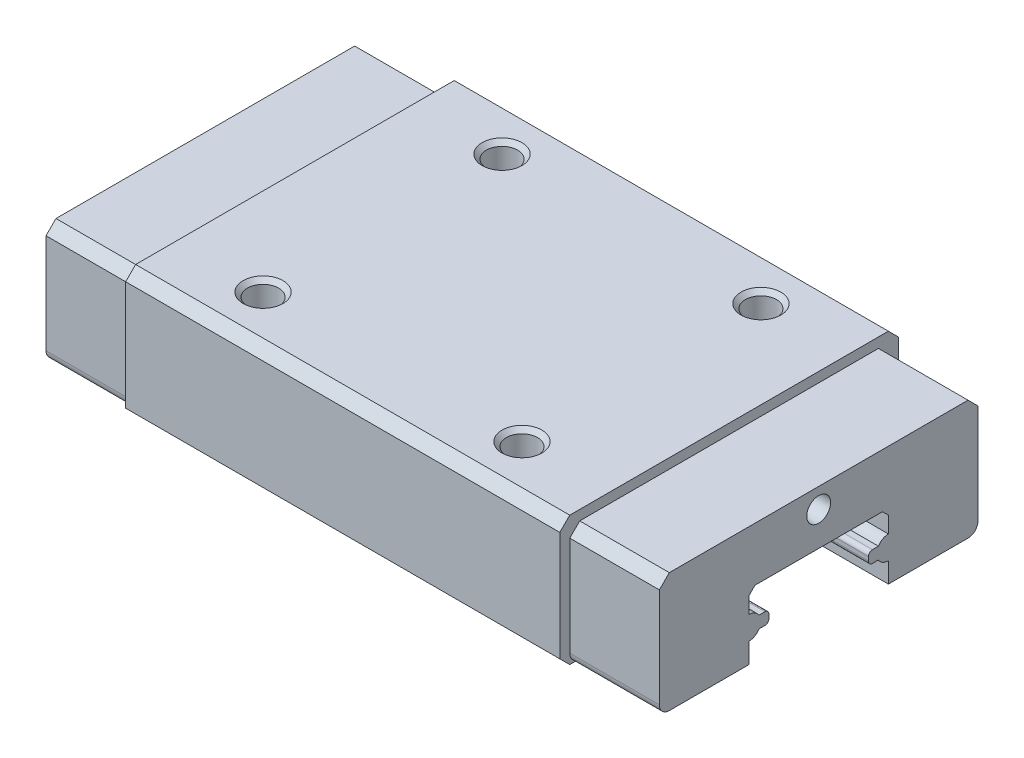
ISO-10303-21;
HEADER;
FILE_DESCRIPTION(('STEP AP214'),'2;1');
FILE_NAME('part.step','',(''),(''),'','','');
FILE_SCHEMA(('AUTOMOTIVE_DESIGN { 1 0 10303 214 1 1 1 1 }'));
ENDSEC;
DATA;
#1=APPLICATION_CONTEXT('core data for automotive mechanical design processes');
#2=APPLICATION_PROTOCOL_DEFINITION('international standard','automotive_design',2000,#1);
#3=PRODUCT_CONTEXT('',#1,'mechanical');
#4=PRODUCT('Part','Part','',(#3));
#5=PRODUCT_RELATED_PRODUCT_CATEGORY('part','',(#4));
#6=PRODUCT_DEFINITION_FORMATION('','',#4);
#7=PRODUCT_DEFINITION_CONTEXT('part definition',#1,'design');
#8=PRODUCT_DEFINITION('design','',#6,#7);
#9=PRODUCT_DEFINITION_SHAPE('','',#8);
#10=(LENGTH_UNIT() NAMED_UNIT(*) SI_UNIT(.MILLI.,.METRE.));
#11=(NAMED_UNIT(*) PLANE_ANGLE_UNIT() SI_UNIT($,.RADIAN.));
#12=(NAMED_UNIT(*) SI_UNIT($,.STERADIAN.) SOLID_ANGLE_UNIT());
#13=UNCERTAINTY_MEASURE_WITH_UNIT(LENGTH_MEASURE(1.E-05),#10,'distance_accuracy_value','');
#14=(GEOMETRIC_REPRESENTATION_CONTEXT(3) GLOBAL_UNCERTAINTY_ASSIGNED_CONTEXT((#13)) GLOBAL_UNIT_ASSIGNED_CONTEXT((#10,
#11,#12)) REPRESENTATION_CONTEXT('',''));
#15=CARTESIAN_POINT('',(0.,0.,0.));
#16=DIRECTION('',(0.,0.,1.));
#17=DIRECTION('',(1.,0.,0.));
#18=AXIS2_PLACEMENT_3D('',#15,#16,#17);
#19=CARTESIAN_POINT('',(57.1,6.,-7.5));
#20=DIRECTION('',(0.,-1.,0.));
#21=DIRECTION('',(0.,0.,-1.));
#22=AXIS2_PLACEMENT_3D('',#19,#20,#21);
#23=PLANE('',#22);
#24=DIRECTION('',(0.,0.,-1.));
#25=VECTOR('',#24,1.);
#26=CARTESIAN_POINT('',(30.8,6.,3.5));
#27=LINE('',#26,#25);
#28=CARTESIAN_POINT('',(30.8,6.,7.5));
#29=VERTEX_POINT('',#28);
#30=CARTESIAN_POINT('',(30.8,6.,-7.5));
#31=VERTEX_POINT('',#30);
#32=EDGE_CURVE('E10',#29,#31,#27,.T.);
#33=ORIENTED_EDGE('',*,*,#32,.T.);
#34=DIRECTION('',(-1.,0.,0.));
#35=VECTOR('',#34,1.);
#36=CARTESIAN_POINT('',(57.1,6.,-7.5));
#37=LINE('',#36,#35);
#38=CARTESIAN_POINT('',(26.3,6.,-7.5));
#39=VERTEX_POINT('',#38);
#40=EDGE_CURVE('E27',#31,#39,#37,.T.);
#41=ORIENTED_EDGE('',*,*,#40,.T.);
#42=DIRECTION('',(0.,0.,1.));
#43=VECTOR('',#42,1.);
#44=CARTESIAN_POINT('',(26.3,6.,-7.5));
#45=LINE('',#44,#43);
#46=CARTESIAN_POINT('',(26.3,6.,7.5));
#47=VERTEX_POINT('',#46);
#48=EDGE_CURVE('E376',#39,#47,#45,.T.);
#49=ORIENTED_EDGE('',*,*,#48,.T.);
#50=DIRECTION('',(-1.,0.,0.));
#51=VECTOR('',#50,1.);
#52=CARTESIAN_POINT('',(57.1,6.,7.5));
#53=LINE('',#52,#51);
#54=EDGE_CURVE('E338',#29,#47,#53,.T.);
#55=ORIENTED_EDGE('',*,*,#54,.F.);
#56=EDGE_LOOP('',(#33,#41,#49,#55));
#57=FACE_BOUND('',#56,.T.);
#58=ADVANCED_FACE('F16',(#57),#23,.F.);
#59=CARTESIAN_POINT('',(57.1,5.5,-8.));
#60=DIRECTION('',(0.,-0.707106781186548,0.707106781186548));
#61=DIRECTION('',(-1.,0.,0.));
#62=AXIS2_PLACEMENT_3D('',#59,#60,#61);
#63=PLANE('',#62);
#64=DIRECTION('',(0.,-0.707106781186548,-0.707106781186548));
#65=VECTOR('',#64,1.);
#66=CARTESIAN_POINT('',(30.8,9.3,-4.2));
#67=LINE('',#66,#65);
#68=CARTESIAN_POINT('',(30.8,5.5,-8.));
#69=VERTEX_POINT('',#68);
#70=EDGE_CURVE('E380',#31,#69,#67,.T.);
#71=ORIENTED_EDGE('',*,*,#70,.T.);
#72=DIRECTION('',(-1.,0.,0.));
#73=VECTOR('',#72,1.);
#74=CARTESIAN_POINT('',(57.1,5.5,-8.));
#75=LINE('',#74,#73);
#76=CARTESIAN_POINT('',(26.3,5.5,-8.));
#77=VERTEX_POINT('',#76);
#78=EDGE_CURVE('E20',#69,#77,#75,.T.);
#79=ORIENTED_EDGE('',*,*,#78,.T.);
#80=DIRECTION('',(0.,0.707106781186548,0.707106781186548));
#81=VECTOR('',#80,1.);
#82=CARTESIAN_POINT('',(26.3,5.5,-8.));
#83=LINE('',#82,#81);
#84=EDGE_CURVE('E553',#77,#39,#83,.T.);
#85=ORIENTED_EDGE('',*,*,#84,.T.);
#86=ORIENTED_EDGE('',*,*,#40,.F.);
#87=EDGE_LOOP('',(#71,#79,#85,#86));
#88=FACE_BOUND('',#87,.T.);
#89=ADVANCED_FACE('F1148',(#88),#63,.F.);
#90=CARTESIAN_POINT('',(57.1,6.,7.5));
#91=DIRECTION('',(0.,-0.707106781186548,-0.707106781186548));
#92=DIRECTION('',(0.,-0.707106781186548,0.707106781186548));
#93=AXIS2_PLACEMENT_3D('',#90,#91,#92);
#94=PLANE('',#93);
#95=DIRECTION('',(0.,0.707106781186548,-0.707106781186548));
#96=VECTOR('',#95,1.);
#97=CARTESIAN_POINT('',(30.8,5.8,7.7));
#98=LINE('',#97,#96);
#99=CARTESIAN_POINT('',(30.8,5.5,8.));
#100=VERTEX_POINT('',#99);
#101=EDGE_CURVE('E341',#100,#29,#98,.T.);
#102=ORIENTED_EDGE('',*,*,#101,.T.);
#103=ORIENTED_EDGE('',*,*,#54,.T.);
#104=DIRECTION('',(0.,-0.707106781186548,0.707106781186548));
#105=VECTOR('',#104,1.);
#106=CARTESIAN_POINT('',(26.3,6.,7.5));
#107=LINE('',#106,#105);
#108=CARTESIAN_POINT('',(26.3,5.5,8.));
#109=VERTEX_POINT('',#108);
#110=EDGE_CURVE('E342',#47,#109,#107,.T.);
#111=ORIENTED_EDGE('',*,*,#110,.T.);
#112=DIRECTION('',(-1.,0.,0.));
#113=VECTOR('',#112,1.);
#114=CARTESIAN_POINT('',(57.1,5.5,8.));
#115=LINE('',#114,#113);
#116=EDGE_CURVE('E324',#100,#109,#115,.T.);
#117=ORIENTED_EDGE('',*,*,#116,.F.);
#118=EDGE_LOOP('',(#102,#103,#111,#117));
#119=FACE_BOUND('',#118,.T.);
#120=ADVANCED_FACE('F1154',(#119),#94,.F.);
#121=CARTESIAN_POINT('',(30.8,6.,8.5));
#122=DIRECTION('',(0.,0.,-1.));
#123=DIRECTION('',(0.,-1.,0.));
#124=AXIS2_PLACEMENT_3D('',#121,#122,#123);
#125=PLANE('',#124);
#126=DIRECTION('',(0.,-1.,0.));
#127=VECTOR('',#126,1.);
#128=CARTESIAN_POINT('',(26.3,6.5,8.5));
#129=LINE('',#128,#127);
#130=CARTESIAN_POINT('',(26.3,6.,8.5));
#131=VERTEX_POINT('',#130);
#132=CARTESIAN_POINT('',(26.3,0.5,8.5));
#133=VERTEX_POINT('',#132);
#134=EDGE_CURVE('E487',#131,#133,#129,.T.);
#135=ORIENTED_EDGE('',*,*,#134,.F.);
#136=DIRECTION('',(-1.,0.,0.));
#137=VECTOR('',#136,1.);
#138=CARTESIAN_POINT('',(30.8,6.,8.5));
#139=LINE('',#138,#137);
#140=CARTESIAN_POINT('',(4.5,6.,8.5));
#141=VERTEX_POINT('',#140);
#142=EDGE_CURVE('E364',#131,#141,#139,.T.);
#143=ORIENTED_EDGE('',*,*,#142,.T.);
#144=DIRECTION('',(0.,-1.,0.));
#145=VECTOR('',#144,1.);
#146=CARTESIAN_POINT('',(4.5,6.5,8.5));
#147=LINE('',#146,#145);
#148=CARTESIAN_POINT('',(4.5,0.5,8.5));
#149=VERTEX_POINT('',#148);
#150=EDGE_CURVE('E649',#141,#149,#147,.T.);
#151=ORIENTED_EDGE('',*,*,#150,.T.);
#152=DIRECTION('',(-1.,0.,0.));
#153=VECTOR('',#152,1.);
#154=CARTESIAN_POINT('',(30.8,0.5,8.5));
#155=LINE('',#154,#153);
#156=EDGE_CURVE('E423',#133,#149,#155,.T.);
#157=ORIENTED_EDGE('',*,*,#156,.F.);
#158=EDGE_LOOP('',(#135,#143,#151,#157));
#159=FACE_BOUND('',#158,.T.);
#160=ADVANCED_FACE('F1196',(#159),#125,.F.);
#161=CARTESIAN_POINT('',(30.8,0.5,8.5));
#162=DIRECTION('',(0.,0.707106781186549,-0.707106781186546));
#163=DIRECTION('',(-1.,0.,0.));
#164=AXIS2_PLACEMENT_3D('',#161,#162,#163);
#165=PLANE('',#164);
#166=DIRECTION('',(0.,-0.707106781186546,-0.707106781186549));
#167=VECTOR('',#166,1.);
#168=CARTESIAN_POINT('',(26.3,0.5,8.5));
#169=LINE('',#168,#167);
#170=CARTESIAN_POINT('',(26.3,0.,8.));
#171=VERTEX_POINT('',#170);
#172=EDGE_CURVE('E460',#133,#171,#169,.T.);
#173=ORIENTED_EDGE('',*,*,#172,.F.);
#174=ORIENTED_EDGE('',*,*,#156,.T.);
#175=DIRECTION('',(0.,-0.707106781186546,-0.707106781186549));
#176=VECTOR('',#175,1.);
#177=CARTESIAN_POINT('',(4.5,0.5,8.5));
#178=LINE('',#177,#176);
#179=CARTESIAN_POINT('',(4.5,0.,8.));
#180=VERTEX_POINT('',#179);
#181=EDGE_CURVE('E669',#149,#180,#178,.T.);
#182=ORIENTED_EDGE('',*,*,#181,.T.);
#183=DIRECTION('',(-1.,0.,0.));
#184=VECTOR('',#183,1.);
#185=CARTESIAN_POINT('',(30.8,0.,8.));
#186=LINE('',#185,#184);
#187=EDGE_CURVE('E482',#171,#180,#186,.T.);
#188=ORIENTED_EDGE('',*,*,#187,.F.);
#189=EDGE_LOOP('',(#173,#174,#182,#188));
#190=FACE_BOUND('',#189,.T.);
#191=ADVANCED_FACE('F764',(#190),#165,.F.);
#192=CARTESIAN_POINT('',(27.4,5.,0.));
#193=DIRECTION('',(-1.,0.,0.));
#194=DIRECTION('',(0.,0.,-1.));
#195=AXIS2_PLACEMENT_3D('',#192,#193,#194);
#196=CYLINDRICAL_SURFACE('',#195,0.6);
#197=CARTESIAN_POINT('',(30.8,5.,0.));
#198=DIRECTION('',(1.,0.,0.));
#199=DIRECTION('',(0.,0.,-1.));
#200=AXIS2_PLACEMENT_3D('',#197,#198,#199);
#201=CIRCLE('',#200,0.6);
#202=CARTESIAN_POINT('',(30.8,5.,-0.6));
#203=VERTEX_POINT('',#202);
#204=EDGE_CURVE('E359',#203,#203,#201,.T.);
#205=ORIENTED_EDGE('',*,*,#204,.T.);
#206=EDGE_LOOP('',(#205));
#207=FACE_BOUND('',#206,.T.);
#208=CARTESIAN_POINT('',(27.4,5.,0.));
#209=DIRECTION('',(1.,0.,0.));
#210=DIRECTION('',(0.,0.,-1.));
#211=AXIS2_PLACEMENT_3D('',#208,#209,#210);
#212=CIRCLE('',#211,0.6);
#213=CARTESIAN_POINT('',(27.4,5.,-0.6));
#214=VERTEX_POINT('',#213);
#215=EDGE_CURVE('E267',#214,#214,#212,.T.);
#216=ORIENTED_EDGE('',*,*,#215,.F.);
#217=EDGE_LOOP('',(#216));
#218=FACE_BOUND('',#217,.T.);
#219=ADVANCED_FACE('F268',(#207,#218),#196,.F.);
#220=CARTESIAN_POINT('',(30.8,1.6,3.5));
#221=DIRECTION('',(1.,0.,0.));
#222=DIRECTION('',(0.,1.,0.));
#223=AXIS2_PLACEMENT_3D('',#220,#221,#222);
#224=PLANE('',#223);
#225=CARTESIAN_POINT('',(30.8,0.5,-7.5));
#226=DIRECTION('',(-1.,0.,0.));
#227=DIRECTION('',(0.,0.,-1.));
#228=AXIS2_PLACEMENT_3D('',#225,#226,#227);
#229=CIRCLE('',#228,0.5);
#230=CARTESIAN_POINT('',(30.8,0.5,-8.));
#231=VERTEX_POINT('',#230);
#232=CARTESIAN_POINT('',(30.8,0.,-7.5));
#233=VERTEX_POINT('',#232);
#234=EDGE_CURVE('E630',#231,#233,#229,.T.);
#235=ORIENTED_EDGE('',*,*,#234,.F.);
#236=DIRECTION('',(0.,-1.,0.));
#237=VECTOR('',#236,1.);
#238=CARTESIAN_POINT('',(30.8,1.6,-8.));
#239=LINE('',#238,#237);
#240=EDGE_CURVE('E526',#69,#231,#239,.T.);
#241=ORIENTED_EDGE('',*,*,#240,.F.);
#242=ORIENTED_EDGE('',*,*,#70,.F.);
#243=ORIENTED_EDGE('',*,*,#32,.F.);
#244=ORIENTED_EDGE('',*,*,#101,.F.);
#245=DIRECTION('',(0.,1.,0.));
#246=VECTOR('',#245,1.);
#247=CARTESIAN_POINT('',(30.8,1.6,8.));
#248=LINE('',#247,#246);
#249=CARTESIAN_POINT('',(30.8,0.5,8.));
#250=VERTEX_POINT('',#249);
#251=EDGE_CURVE('E299',#250,#100,#248,.T.);
#252=ORIENTED_EDGE('',*,*,#251,.F.);
#253=CARTESIAN_POINT('',(30.8,0.5,7.5));
#254=DIRECTION('',(-1.,0.,0.));
#255=DIRECTION('',(0.,0.,-1.));
#256=AXIS2_PLACEMENT_3D('',#253,#254,#255);
#257=CIRCLE('',#256,0.5);
#258=CARTESIAN_POINT('',(30.8,0.,7.5));
#259=VERTEX_POINT('',#258);
#260=EDGE_CURVE('E349',#259,#250,#257,.T.);
#261=ORIENTED_EDGE('',*,*,#260,.F.);
#262=DIRECTION('',(0.,0.,-1.));
#263=VECTOR('',#262,1.);
#264=CARTESIAN_POINT('',(30.8,0.,8.));
#265=LINE('',#264,#263);
#266=CARTESIAN_POINT('',(30.8,0.,3.5));
#267=VERTEX_POINT('',#266);
#268=EDGE_CURVE('E355',#259,#267,#265,.T.);
#269=ORIENTED_EDGE('',*,*,#268,.T.);
#270=DIRECTION('',(0.,1.,0.));
#271=VECTOR('',#270,1.);
#272=CARTESIAN_POINT('',(30.8,0.,3.5));
#273=LINE('',#272,#271);
#274=CARTESIAN_POINT('',(30.8,1.01690481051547,3.5));
#275=VERTEX_POINT('',#274);
#276=EDGE_CURVE('E360',#267,#275,#273,.T.);
#277=ORIENTED_EDGE('',*,*,#276,.T.);
#278=CARTESIAN_POINT('',(30.8,1.6,3.5));
#279=DIRECTION('',(1.,0.,0.));
#280=DIRECTION('',(0.,0.,-1.));
#281=AXIS2_PLACEMENT_3D('',#278,#279,#280);
#282=CIRCLE('',#281,0.5830951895);
#283=CARTESIAN_POINT('',(30.8,1.3,3.));
#284=VERTEX_POINT('',#283);
#285=EDGE_CURVE('E452',#275,#284,#282,.T.);
#286=ORIENTED_EDGE('',*,*,#285,.T.);
#287=DIRECTION('',(0.,0.,-1.));
#288=VECTOR('',#287,1.);
#289=CARTESIAN_POINT('',(30.8,1.3,3.));
#290=LINE('',#289,#288);
#291=CARTESIAN_POINT('',(30.8,1.3,2.7));
#292=VERTEX_POINT('',#291);
#293=EDGE_CURVE('E448',#284,#292,#290,.T.);
#294=ORIENTED_EDGE('',*,*,#293,.T.);
#295=CARTESIAN_POINT('',(30.8,1.5,2.7));
#296=DIRECTION('',(1.,0.,0.));
#297=DIRECTION('',(0.,0.,-1.));
#298=AXIS2_PLACEMENT_3D('',#295,#296,#297);
#299=CIRCLE('',#298,0.2);
#300=CARTESIAN_POINT('',(30.8,1.5,2.5));
#301=VERTEX_POINT('',#300);
#302=EDGE_CURVE('E453',#292,#301,#299,.T.);
#303=ORIENTED_EDGE('',*,*,#302,.T.);
#304=DIRECTION('',(0.,1.,0.));
#305=VECTOR('',#304,1.);
#306=CARTESIAN_POINT('',(30.8,1.5,2.5));
#307=LINE('',#306,#305);
#308=CARTESIAN_POINT('',(30.8,1.7,2.5));
#309=VERTEX_POINT('',#308);
#310=EDGE_CURVE('E538',#301,#309,#307,.T.);
#311=ORIENTED_EDGE('',*,*,#310,.T.);
#312=CARTESIAN_POINT('',(30.8,1.7,2.7));
#313=DIRECTION('',(1.,0.,0.));
#314=DIRECTION('',(0.,0.,-1.));
#315=AXIS2_PLACEMENT_3D('',#312,#313,#314);
#316=CIRCLE('',#315,0.2);
#317=CARTESIAN_POINT('',(30.8,1.9,2.7));
#318=VERTEX_POINT('',#317);
#319=EDGE_CURVE('E542',#309,#318,#316,.T.);
#320=ORIENTED_EDGE('',*,*,#319,.T.);
#321=DIRECTION('',(0.,0.,1.));
#322=VECTOR('',#321,1.);
#323=CARTESIAN_POINT('',(30.8,1.9,2.7));
#324=LINE('',#323,#322);
#325=CARTESIAN_POINT('',(30.8,1.9,3.));
#326=VERTEX_POINT('',#325);
#327=EDGE_CURVE('E600',#318,#326,#324,.T.);
#328=ORIENTED_EDGE('',*,*,#327,.T.);
#329=CARTESIAN_POINT('',(30.8,1.6,3.5));
#330=DIRECTION('',(1.,0.,0.));
#331=DIRECTION('',(0.,0.,-1.));
#332=AXIS2_PLACEMENT_3D('',#329,#330,#331);
#333=CIRCLE('',#332,0.5830951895);
#334=CARTESIAN_POINT('',(30.8,2.18309518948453,3.5));
#335=VERTEX_POINT('',#334);
#336=EDGE_CURVE('E596',#326,#335,#333,.T.);
#337=ORIENTED_EDGE('',*,*,#336,.T.);
#338=DIRECTION('',(0.,1.,0.));
#339=VECTOR('',#338,1.);
#340=CARTESIAN_POINT('',(30.8,2.18309518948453,3.5));
#341=LINE('',#340,#339);
#342=CARTESIAN_POINT('',(30.8,3.,3.5));
#343=VERTEX_POINT('',#342);
#344=EDGE_CURVE('E304',#335,#343,#341,.T.);
#345=ORIENTED_EDGE('',*,*,#344,.T.);
#346=DIRECTION('',(0.,0.707106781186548,-0.707106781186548));
#347=VECTOR('',#346,1.);
#348=CARTESIAN_POINT('',(30.8,3.,3.5));
#349=LINE('',#348,#347);
#350=CARTESIAN_POINT('',(30.8,3.3,3.2));
#351=VERTEX_POINT('',#350);
#352=EDGE_CURVE('E300',#343,#351,#349,.T.);
#353=ORIENTED_EDGE('',*,*,#352,.T.);
#354=DIRECTION('',(0.,0.,-1.));
#355=VECTOR('',#354,1.);
#356=CARTESIAN_POINT('',(30.8,3.3,3.2));
#357=LINE('',#356,#355);
#358=CARTESIAN_POINT('',(30.8,3.3,-3.2));
#359=VERTEX_POINT('',#358);
#360=EDGE_CURVE('E305',#351,#359,#357,.T.);
#361=ORIENTED_EDGE('',*,*,#360,.T.);
#362=DIRECTION('',(0.,-0.707106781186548,-0.707106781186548));
#363=VECTOR('',#362,1.);
#364=CARTESIAN_POINT('',(30.8,3.3,-3.2));
#365=LINE('',#364,#363);
#366=CARTESIAN_POINT('',(30.8,3.,-3.5));
#367=VERTEX_POINT('',#366);
#368=EDGE_CURVE('E604',#359,#367,#365,.T.);
#369=ORIENTED_EDGE('',*,*,#368,.T.);
#370=DIRECTION('',(0.,-1.,0.));
#371=VECTOR('',#370,1.);
#372=CARTESIAN_POINT('',(30.8,3.,-3.5));
#373=LINE('',#372,#371);
#374=CARTESIAN_POINT('',(30.8,2.18309518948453,-3.5));
#375=VERTEX_POINT('',#374);
#376=EDGE_CURVE('E347',#367,#375,#373,.T.);
#377=ORIENTED_EDGE('',*,*,#376,.T.);
#378=CARTESIAN_POINT('',(30.8,1.6,-3.5));
#379=DIRECTION('',(1.,0.,0.));
#380=DIRECTION('',(0.,0.,-1.));
#381=AXIS2_PLACEMENT_3D('',#378,#379,#380);
#382=CIRCLE('',#381,0.5830951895);
#383=CARTESIAN_POINT('',(30.8,1.9,-3.));
#384=VERTEX_POINT('',#383);
#385=EDGE_CURVE('E343',#375,#384,#382,.T.);
#386=ORIENTED_EDGE('',*,*,#385,.T.);
#387=DIRECTION('',(0.,0.,1.));
#388=VECTOR('',#387,1.);
#389=CARTESIAN_POINT('',(30.8,1.9,-3.));
#390=LINE('',#389,#388);
#391=CARTESIAN_POINT('',(30.8,1.9,-2.7));
#392=VERTEX_POINT('',#391);
#393=EDGE_CURVE('E348',#384,#392,#390,.T.);
#394=ORIENTED_EDGE('',*,*,#393,.T.);
#395=CARTESIAN_POINT('',(30.8,1.7,-2.7));
#396=DIRECTION('',(1.,0.,0.));
#397=DIRECTION('',(0.,0.,-1.));
#398=AXIS2_PLACEMENT_3D('',#395,#396,#397);
#399=CIRCLE('',#398,0.2);
#400=CARTESIAN_POINT('',(30.8,1.7,-2.5));
#401=VERTEX_POINT('',#400);
#402=EDGE_CURVE('E310',#392,#401,#399,.T.);
#403=ORIENTED_EDGE('',*,*,#402,.T.);
#404=DIRECTION('',(0.,-1.,0.));
#405=VECTOR('',#404,1.);
#406=CARTESIAN_POINT('',(30.8,1.7,-2.5));
#407=LINE('',#406,#405);
#408=CARTESIAN_POINT('',(30.8,1.5,-2.5));
#409=VERTEX_POINT('',#408);
#410=EDGE_CURVE('E306',#401,#409,#407,.T.);
#411=ORIENTED_EDGE('',*,*,#410,.T.);
#412=CARTESIAN_POINT('',(30.8,1.5,-2.7));
#413=DIRECTION('',(1.,0.,0.));
#414=DIRECTION('',(0.,0.,-1.));
#415=AXIS2_PLACEMENT_3D('',#412,#413,#414);
#416=CIRCLE('',#415,0.2);
#417=CARTESIAN_POINT('',(30.8,1.3,-2.7));
#418=VERTEX_POINT('',#417);
#419=EDGE_CURVE('E311',#409,#418,#416,.T.);
#420=ORIENTED_EDGE('',*,*,#419,.T.);
#421=DIRECTION('',(0.,0.,-1.));
#422=VECTOR('',#421,1.);
#423=CARTESIAN_POINT('',(30.8,1.3,-2.7));
#424=LINE('',#423,#422);
#425=CARTESIAN_POINT('',(30.8,1.3,-3.));
#426=VERTEX_POINT('',#425);
#427=EDGE_CURVE('E727',#418,#426,#424,.T.);
#428=ORIENTED_EDGE('',*,*,#427,.T.);
#429=CARTESIAN_POINT('',(30.8,1.6,-3.5));
#430=DIRECTION('',(1.,0.,0.));
#431=DIRECTION('',(0.,0.,-1.));
#432=AXIS2_PLACEMENT_3D('',#429,#430,#431);
#433=CIRCLE('',#432,0.5830951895);
#434=CARTESIAN_POINT('',(30.8,1.01690481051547,-3.5));
#435=VERTEX_POINT('',#434);
#436=EDGE_CURVE('E286',#426,#435,#433,.T.);
#437=ORIENTED_EDGE('',*,*,#436,.T.);
#438=DIRECTION('',(0.,-1.,0.));
#439=VECTOR('',#438,1.);
#440=CARTESIAN_POINT('',(30.8,1.01690481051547,-3.5));
#441=LINE('',#440,#439);
#442=CARTESIAN_POINT('',(30.8,0.,-3.5));
#443=VERTEX_POINT('',#442);
#444=EDGE_CURVE('E283',#435,#443,#441,.T.);
#445=ORIENTED_EDGE('',*,*,#444,.T.);
#446=DIRECTION('',(0.,0.,-1.));
#447=VECTOR('',#446,1.);
#448=CARTESIAN_POINT('',(30.8,0.,-3.5));
#449=LINE('',#448,#447);
#450=EDGE_CURVE('E287',#443,#233,#449,.T.);
#451=ORIENTED_EDGE('',*,*,#450,.T.);
#452=EDGE_LOOP('',(#235,#241,#242,#243,#244,#252,#261,#269,#277,#286,#294,#303,#311,#320,#328,
#337,#345,#353,#361,#369,#377,#386,#394,#403,#411,#420,#428,#437,#445,#451));
#453=FACE_BOUND('',#452,.T.);
#454=ORIENTED_EDGE('',*,*,#204,.F.);
#455=EDGE_LOOP('',(#454));
#456=FACE_BOUND('',#455,.T.);
#457=ADVANCED_FACE('F917',(#453,#456),#224,.T.);
#458=CARTESIAN_POINT('',(4.5,0.,0.));
#459=DIRECTION('',(1.,0.,0.));
#460=DIRECTION('',(0.,1.,0.));
#461=AXIS2_PLACEMENT_3D('',#458,#459,#460);
#462=PLANE('',#461);
#463=ORIENTED_EDGE('',*,*,#150,.F.);
#464=DIRECTION('',(0.,-0.707106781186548,0.707106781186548));
#465=VECTOR('',#464,1.);
#466=CARTESIAN_POINT('',(4.5,6.5,8.));
#467=LINE('',#466,#465);
#468=CARTESIAN_POINT('',(4.5,6.5,8.));
#469=VERTEX_POINT('',#468);
#470=EDGE_CURVE('E412',#469,#141,#467,.T.);
#471=ORIENTED_EDGE('',*,*,#470,.F.);
#472=DIRECTION('',(0.,0.,1.));
#473=VECTOR('',#472,1.);
#474=CARTESIAN_POINT('',(4.5,6.5,-8.5));
#475=LINE('',#474,#473);
#476=CARTESIAN_POINT('',(4.5,6.5,-8.));
#477=VERTEX_POINT('',#476);
#478=EDGE_CURVE('E391',#477,#469,#475,.T.);
#479=ORIENTED_EDGE('',*,*,#478,.F.);
#480=DIRECTION('',(0.,0.707106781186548,0.707106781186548));
#481=VECTOR('',#480,1.);
#482=CARTESIAN_POINT('',(4.5,6.,-8.5));
#483=LINE('',#482,#481);
#484=CARTESIAN_POINT('',(4.5,6.,-8.5));
#485=VERTEX_POINT('',#484);
#486=EDGE_CURVE('E560',#485,#477,#483,.T.);
#487=ORIENTED_EDGE('',*,*,#486,.F.);
#488=DIRECTION('',(0.,1.,0.));
#489=VECTOR('',#488,1.);
#490=CARTESIAN_POINT('',(4.5,-1.,-8.5));
#491=LINE('',#490,#489);
#492=CARTESIAN_POINT('',(4.5,0.5,-8.5));
#493=VERTEX_POINT('',#492);
#494=EDGE_CURVE('E676',#493,#485,#491,.T.);
#495=ORIENTED_EDGE('',*,*,#494,.F.);
#496=DIRECTION('',(0.,0.707106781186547,-0.707106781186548));
#497=VECTOR('',#496,1.);
#498=CARTESIAN_POINT('',(4.5,0.,-8.));
#499=LINE('',#498,#497);
#500=CARTESIAN_POINT('',(4.5,0.,-8.));
#501=VERTEX_POINT('',#500);
#502=EDGE_CURVE('E644',#501,#493,#499,.T.);
#503=ORIENTED_EDGE('',*,*,#502,.F.);
#504=DIRECTION('',(0.,0.,-1.));
#505=VECTOR('',#504,1.);
#506=CARTESIAN_POINT('',(4.5,0.,-3.5));
#507=LINE('',#506,#505);
#508=CARTESIAN_POINT('',(4.5,0.,-7.5));
#509=VERTEX_POINT('',#508);
#510=EDGE_CURVE('E400',#509,#501,#507,.T.);
#511=ORIENTED_EDGE('',*,*,#510,.F.);
#512=CARTESIAN_POINT('',(4.5,0.5,-7.5));
#513=DIRECTION('',(1.,0.,0.));
#514=DIRECTION('',(0.,0.,-1.));
#515=AXIS2_PLACEMENT_3D('',#512,#513,#514);
#516=CIRCLE('',#515,0.5);
#517=CARTESIAN_POINT('',(4.5,0.5,-8.));
#518=VERTEX_POINT('',#517);
#519=EDGE_CURVE('E469',#509,#518,#516,.T.);
#520=ORIENTED_EDGE('',*,*,#519,.T.);
#521=DIRECTION('',(0.,1.,0.));
#522=VECTOR('',#521,1.);
#523=CARTESIAN_POINT('',(4.5,0.5,-8.));
#524=LINE('',#523,#522);
#525=CARTESIAN_POINT('',(4.5,5.5,-8.));
#526=VERTEX_POINT('',#525);
#527=EDGE_CURVE('E464',#518,#526,#524,.T.);
#528=ORIENTED_EDGE('',*,*,#527,.T.);
#529=DIRECTION('',(0.,0.707106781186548,0.707106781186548));
#530=VECTOR('',#529,1.);
#531=CARTESIAN_POINT('',(4.5,5.5,-8.));
#532=LINE('',#531,#530);
#533=CARTESIAN_POINT('',(4.5,6.,-7.5));
#534=VERTEX_POINT('',#533);
#535=EDGE_CURVE('E396',#526,#534,#532,.T.);
#536=ORIENTED_EDGE('',*,*,#535,.T.);
#537=DIRECTION('',(0.,0.,1.));
#538=VECTOR('',#537,1.);
#539=CARTESIAN_POINT('',(4.5,6.,-7.5));
#540=LINE('',#539,#538);
#541=CARTESIAN_POINT('',(4.5,6.,7.5));
#542=VERTEX_POINT('',#541);
#543=EDGE_CURVE('E393',#534,#542,#540,.T.);
#544=ORIENTED_EDGE('',*,*,#543,.T.);
#545=DIRECTION('',(0.,-0.707106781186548,0.707106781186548));
#546=VECTOR('',#545,1.);
#547=CARTESIAN_POINT('',(4.5,6.,7.5));
#548=LINE('',#547,#546);
#549=CARTESIAN_POINT('',(4.5,5.5,8.));
#550=VERTEX_POINT('',#549);
#551=EDGE_CURVE('E322',#542,#550,#548,.T.);
#552=ORIENTED_EDGE('',*,*,#551,.T.);
#553=DIRECTION('',(0.,-1.,0.));
#554=VECTOR('',#553,1.);
#555=CARTESIAN_POINT('',(4.5,5.5,8.));
#556=LINE('',#555,#554);
#557=CARTESIAN_POINT('',(4.5,0.5,8.));
#558=VERTEX_POINT('',#557);
#559=EDGE_CURVE('E318',#550,#558,#556,.T.);
#560=ORIENTED_EDGE('',*,*,#559,.T.);
#561=CARTESIAN_POINT('',(4.5,0.5,7.5));
#562=DIRECTION('',(1.,0.,0.));
#563=DIRECTION('',(0.,0.,-1.));
#564=AXIS2_PLACEMENT_3D('',#561,#562,#563);
#565=CIRCLE('',#564,0.5);
#566=CARTESIAN_POINT('',(4.5,0.,7.5));
#567=VERTEX_POINT('',#566);
#568=EDGE_CURVE('E323',#558,#567,#565,.T.);
#569=ORIENTED_EDGE('',*,*,#568,.T.);
#570=DIRECTION('',(0.,0.,-1.));
#571=VECTOR('',#570,1.);
#572=CARTESIAN_POINT('',(4.5,0.,8.));
#573=LINE('',#572,#571);
#574=EDGE_CURVE('E479',#180,#567,#573,.T.);
#575=ORIENTED_EDGE('',*,*,#574,.F.);
#576=ORIENTED_EDGE('',*,*,#181,.F.);
#577=EDGE_LOOP('',(#463,#471,#479,#487,#495,#503,#511,#520,#528,#536,#544,#552,#560,#569,#575,#576));
#578=FACE_BOUND('',#577,.T.);
#579=ADVANCED_FACE('F769',(#578),#462,.F.);
#580=CARTESIAN_POINT('',(30.8,0.,-3.5));
#581=DIRECTION('',(0.,1.,0.));
#582=DIRECTION('',(1.,0.,0.));
#583=AXIS2_PLACEMENT_3D('',#580,#581,#582);
#584=PLANE('',#583);
#585=DIRECTION('',(-1.,0.,0.));
#586=VECTOR('',#585,1.);
#587=CARTESIAN_POINT('',(30.8,0.,-3.5));
#588=LINE('',#587,#586);
#589=CARTESIAN_POINT('',(0.,0.,-3.5));
#590=VERTEX_POINT('',#589);
#591=EDGE_CURVE('E331',#443,#590,#588,.T.);
#592=ORIENTED_EDGE('',*,*,#591,.T.);
#593=DIRECTION('',(0.,0.,-1.));
#594=VECTOR('',#593,1.);
#595=CARTESIAN_POINT('',(0.,0.,-3.5));
#596=LINE('',#595,#594);
#597=CARTESIAN_POINT('',(0.,0.,-7.5));
#598=VERTEX_POINT('',#597);
#599=EDGE_CURVE('E508',#590,#598,#596,.T.);
#600=ORIENTED_EDGE('',*,*,#599,.T.);
#601=DIRECTION('',(1.,0.,0.));
#602=VECTOR('',#601,1.);
#603=CARTESIAN_POINT('',(-26.3,0.,-7.5));
#604=LINE('',#603,#602);
#605=EDGE_CURVE('E408',#598,#509,#604,.T.);
#606=ORIENTED_EDGE('',*,*,#605,.T.);
#607=ORIENTED_EDGE('',*,*,#510,.T.);
#608=DIRECTION('',(-1.,0.,0.));
#609=VECTOR('',#608,1.);
#610=CARTESIAN_POINT('',(30.8,0.,-8.));
#611=LINE('',#610,#609);
#612=CARTESIAN_POINT('',(26.3,0.,-8.));
#613=VERTEX_POINT('',#612);
#614=EDGE_CURVE('E648',#613,#501,#611,.T.);
#615=ORIENTED_EDGE('',*,*,#614,.F.);
#616=DIRECTION('',(0.,0.,-1.));
#617=VECTOR('',#616,1.);
#618=CARTESIAN_POINT('',(26.3,0.,-3.5));
#619=LINE('',#618,#617);
#620=CARTESIAN_POINT('',(26.3,0.,-7.5));
#621=VERTEX_POINT('',#620);
#622=EDGE_CURVE('E431',#621,#613,#619,.T.);
#623=ORIENTED_EDGE('',*,*,#622,.F.);
#624=DIRECTION('',(-1.,0.,0.));
#625=VECTOR('',#624,1.);
#626=CARTESIAN_POINT('',(57.1,0.,-7.5));
#627=LINE('',#626,#625);
#628=EDGE_CURVE('E626',#233,#621,#627,.T.);
#629=ORIENTED_EDGE('',*,*,#628,.F.);
#630=ORIENTED_EDGE('',*,*,#450,.F.);
#631=EDGE_LOOP('',(#592,#600,#606,#607,#615,#623,#629,#630));
#632=FACE_BOUND('',#631,.T.);
#633=ADVANCED_FACE('F1214',(#632),#584,.F.);
#634=CARTESIAN_POINT('',(0.,1.6,3.5));
#635=DIRECTION('',(1.,0.,0.));
#636=DIRECTION('',(0.,1.,0.));
#637=AXIS2_PLACEMENT_3D('',#634,#635,#636);
#638=PLANE('',#637);
#639=CARTESIAN_POINT('',(0.,0.5,-7.5));
#640=DIRECTION('',(1.,0.,0.));
#641=DIRECTION('',(0.,0.,-1.));
#642=AXIS2_PLACEMENT_3D('',#639,#640,#641);
#643=CIRCLE('',#642,0.5);
#644=CARTESIAN_POINT('',(0.,0.5,-8.));
#645=VERTEX_POINT('',#644);
#646=EDGE_CURVE('E659',#598,#645,#643,.T.);
#647=ORIENTED_EDGE('',*,*,#646,.F.);
#648=ORIENTED_EDGE('',*,*,#599,.F.);
#649=DIRECTION('',(0.,-1.,0.));
#650=VECTOR('',#649,1.);
#651=CARTESIAN_POINT('',(0.,1.01690481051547,-3.5));
#652=LINE('',#651,#650);
#653=CARTESIAN_POINT('',(0.,1.01690481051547,-3.5));
#654=VERTEX_POINT('',#653);
#655=EDGE_CURVE('E582',#654,#590,#652,.T.);
#656=ORIENTED_EDGE('',*,*,#655,.F.);
#657=CARTESIAN_POINT('',(0.,1.6,-3.5));
#658=DIRECTION('',(1.,0.,0.));
#659=DIRECTION('',(0.,0.,-1.));
#660=AXIS2_PLACEMENT_3D('',#657,#658,#659);
#661=CIRCLE('',#660,0.5830951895);
#662=CARTESIAN_POINT('',(0.,1.3,-3.));
#663=VERTEX_POINT('',#662);
#664=EDGE_CURVE('E583',#663,#654,#661,.T.);
#665=ORIENTED_EDGE('',*,*,#664,.F.);
#666=DIRECTION('',(0.,0.,-1.));
#667=VECTOR('',#666,1.);
#668=CARTESIAN_POINT('',(0.,1.3,-2.7));
#669=LINE('',#668,#667);
#670=CARTESIAN_POINT('',(0.,1.3,-2.7));
#671=VERTEX_POINT('',#670);
#672=EDGE_CURVE('E710',#671,#663,#669,.T.);
#673=ORIENTED_EDGE('',*,*,#672,.F.);
#674=CARTESIAN_POINT('',(0.,1.5,-2.7));
#675=DIRECTION('',(1.,0.,0.));
#676=DIRECTION('',(0.,0.,-1.));
#677=AXIS2_PLACEMENT_3D('',#674,#675,#676);
#678=CIRCLE('',#677,0.2);
#679=CARTESIAN_POINT('',(0.,1.5,-2.5));
#680=VERTEX_POINT('',#679);
#681=EDGE_CURVE('E477',#680,#671,#678,.T.);
#682=ORIENTED_EDGE('',*,*,#681,.F.);
#683=DIRECTION('',(0.,-1.,0.));
#684=VECTOR('',#683,1.);
#685=CARTESIAN_POINT('',(0.,1.7,-2.5));
#686=LINE('',#685,#684);
#687=CARTESIAN_POINT('',(0.,1.7,-2.5));
#688=VERTEX_POINT('',#687);
#689=EDGE_CURVE('E478',#688,#680,#686,.T.);
#690=ORIENTED_EDGE('',*,*,#689,.F.);
#691=CARTESIAN_POINT('',(0.,1.7,-2.7));
#692=DIRECTION('',(1.,0.,0.));
#693=DIRECTION('',(0.,0.,-1.));
#694=AXIS2_PLACEMENT_3D('',#691,#692,#693);
#695=CIRCLE('',#694,0.2);
#696=CARTESIAN_POINT('',(0.,1.9,-2.7));
#697=VERTEX_POINT('',#696);
#698=EDGE_CURVE('E568',#697,#688,#695,.T.);
#699=ORIENTED_EDGE('',*,*,#698,.F.);
#700=DIRECTION('',(0.,0.,1.));
#701=VECTOR('',#700,1.);
#702=CARTESIAN_POINT('',(0.,1.9,-3.));
#703=LINE('',#702,#701);
#704=CARTESIAN_POINT('',(0.,1.9,-3.));
#705=VERTEX_POINT('',#704);
#706=EDGE_CURVE('E371',#705,#697,#703,.T.);
#707=ORIENTED_EDGE('',*,*,#706,.F.);
#708=CARTESIAN_POINT('',(0.,1.6,-3.5));
#709=DIRECTION('',(1.,0.,0.));
#710=DIRECTION('',(0.,0.,-1.));
#711=AXIS2_PLACEMENT_3D('',#708,#709,#710);
#712=CIRCLE('',#711,0.5830951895);
#713=CARTESIAN_POINT('',(0.,2.18309518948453,-3.5));
#714=VERTEX_POINT('',#713);
#715=EDGE_CURVE('E613',#714,#705,#712,.T.);
#716=ORIENTED_EDGE('',*,*,#715,.F.);
#717=DIRECTION('',(0.,-1.,0.));
#718=VECTOR('',#717,1.);
#719=CARTESIAN_POINT('',(0.,3.,-3.5));
#720=LINE('',#719,#718);
#721=CARTESIAN_POINT('',(0.,3.,-3.5));
#722=VERTEX_POINT('',#721);
#723=EDGE_CURVE('E436',#722,#714,#720,.T.);
#724=ORIENTED_EDGE('',*,*,#723,.F.);
#725=DIRECTION('',(0.,-0.707106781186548,-0.707106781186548));
#726=VECTOR('',#725,1.);
#727=CARTESIAN_POINT('',(0.,3.3,-3.2));
#728=LINE('',#727,#726);
#729=CARTESIAN_POINT('',(0.,3.3,-3.2));
#730=VERTEX_POINT('',#729);
#731=EDGE_CURVE('E332',#730,#722,#728,.T.);
#732=ORIENTED_EDGE('',*,*,#731,.F.);
#733=DIRECTION('',(0.,0.,-1.));
#734=VECTOR('',#733,1.);
#735=CARTESIAN_POINT('',(0.,3.3,3.2));
#736=LINE('',#735,#734);
#737=CARTESIAN_POINT('',(0.,3.3,3.2));
#738=VERTEX_POINT('',#737);
#739=EDGE_CURVE('E369',#738,#730,#736,.T.);
#740=ORIENTED_EDGE('',*,*,#739,.F.);
#741=DIRECTION('',(0.,0.707106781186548,-0.707106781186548));
#742=VECTOR('',#741,1.);
#743=CARTESIAN_POINT('',(0.,3.,3.5));
#744=LINE('',#743,#742);
#745=CARTESIAN_POINT('',(0.,3.,3.5));
#746=VERTEX_POINT('',#745);
#747=EDGE_CURVE('E370',#746,#738,#744,.T.);
#748=ORIENTED_EDGE('',*,*,#747,.F.);
#749=DIRECTION('',(0.,1.,0.));
#750=VECTOR('',#749,1.);
#751=CARTESIAN_POINT('',(0.,2.18309518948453,3.5));
#752=LINE('',#751,#750);
#753=CARTESIAN_POINT('',(0.,2.18309518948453,3.5));
#754=VERTEX_POINT('',#753);
#755=EDGE_CURVE('E312',#754,#746,#752,.T.);
#756=ORIENTED_EDGE('',*,*,#755,.F.);
#757=CARTESIAN_POINT('',(0.,1.6,3.5));
#758=DIRECTION('',(1.,0.,0.));
#759=DIRECTION('',(0.,0.,-1.));
#760=AXIS2_PLACEMENT_3D('',#757,#758,#759);
#761=CIRCLE('',#760,0.5830951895);
#762=CARTESIAN_POINT('',(0.,1.9,3.));
#763=VERTEX_POINT('',#762);
#764=EDGE_CURVE('E441',#763,#754,#761,.T.);
#765=ORIENTED_EDGE('',*,*,#764,.F.);
#766=DIRECTION('',(0.,0.,1.));
#767=VECTOR('',#766,1.);
#768=CARTESIAN_POINT('',(0.,1.9,2.7));
#769=LINE('',#768,#767);
#770=CARTESIAN_POINT('',(0.,1.9,2.7));
#771=VERTEX_POINT('',#770);
#772=EDGE_CURVE('E442',#771,#763,#769,.T.);
#773=ORIENTED_EDGE('',*,*,#772,.F.);
#774=CARTESIAN_POINT('',(0.,1.7,2.7));
#775=DIRECTION('',(1.,0.,0.));
#776=DIRECTION('',(0.,0.,-1.));
#777=AXIS2_PLACEMENT_3D('',#774,#775,#776);
#778=CIRCLE('',#777,0.2);
#779=CARTESIAN_POINT('',(0.,1.7,2.5));
#780=VERTEX_POINT('',#779);
#781=EDGE_CURVE('E447',#780,#771,#778,.T.);
#782=ORIENTED_EDGE('',*,*,#781,.F.);
#783=DIRECTION('',(0.,1.,0.));
#784=VECTOR('',#783,1.);
#785=CARTESIAN_POINT('',(0.,1.5,2.5));
#786=LINE('',#785,#784);
#787=CARTESIAN_POINT('',(0.,1.5,2.5));
#788=VERTEX_POINT('',#787);
#789=EDGE_CURVE('E501',#788,#780,#786,.T.);
#790=ORIENTED_EDGE('',*,*,#789,.F.);
#791=CARTESIAN_POINT('',(0.,1.5,2.7));
#792=DIRECTION('',(1.,0.,0.));
#793=DIRECTION('',(0.,0.,-1.));
#794=AXIS2_PLACEMENT_3D('',#791,#792,#793);
#795=CIRCLE('',#794,0.2);
#796=CARTESIAN_POINT('',(0.,1.3,2.7));
#797=VERTEX_POINT('',#796);
#798=EDGE_CURVE('E502',#797,#788,#795,.T.);
#799=ORIENTED_EDGE('',*,*,#798,.F.);
#800=DIRECTION('',(0.,0.,-1.));
#801=VECTOR('',#800,1.);
#802=CARTESIAN_POINT('',(0.,1.3,3.));
#803=LINE('',#802,#801);
#804=CARTESIAN_POINT('',(0.,1.3,3.));
#805=VERTEX_POINT('',#804);
#806=EDGE_CURVE('E507',#805,#797,#803,.T.);
#807=ORIENTED_EDGE('',*,*,#806,.F.);
#808=CARTESIAN_POINT('',(0.,1.6,3.5));
#809=DIRECTION('',(1.,0.,0.));
#810=DIRECTION('',(0.,0.,-1.));
#811=AXIS2_PLACEMENT_3D('',#808,#809,#810);
#812=CIRCLE('',#811,0.5830951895);
#813=CARTESIAN_POINT('',(0.,1.01690481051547,3.5));
#814=VERTEX_POINT('',#813);
#815=EDGE_CURVE('E547',#814,#805,#812,.T.);
#816=ORIENTED_EDGE('',*,*,#815,.F.);
#817=DIRECTION('',(0.,1.,0.));
#818=VECTOR('',#817,1.);
#819=CARTESIAN_POINT('',(0.,0.,3.5));
#820=LINE('',#819,#818);
#821=CARTESIAN_POINT('',(0.,0.,3.5));
#822=VERTEX_POINT('',#821);
#823=EDGE_CURVE('E705',#822,#814,#820,.T.);
#824=ORIENTED_EDGE('',*,*,#823,.F.);
#825=DIRECTION('',(0.,0.,-1.));
#826=VECTOR('',#825,1.);
#827=CARTESIAN_POINT('',(0.,0.,8.));
#828=LINE('',#827,#826);
#829=CARTESIAN_POINT('',(0.,0.,7.5));
#830=VERTEX_POINT('',#829);
#831=EDGE_CURVE('E483',#830,#822,#828,.T.);
#832=ORIENTED_EDGE('',*,*,#831,.F.);
#833=CARTESIAN_POINT('',(0.,0.5,7.5));
#834=DIRECTION('',(1.,0.,0.));
#835=DIRECTION('',(0.,0.,-1.));
#836=AXIS2_PLACEMENT_3D('',#833,#834,#835);
#837=CIRCLE('',#836,0.5);
#838=CARTESIAN_POINT('',(0.,0.5,8.));
#839=VERTEX_POINT('',#838);
#840=EDGE_CURVE('E288',#839,#830,#837,.T.);
#841=ORIENTED_EDGE('',*,*,#840,.F.);
#842=DIRECTION('',(0.,-1.,0.));
#843=VECTOR('',#842,1.);
#844=CARTESIAN_POINT('',(0.,1.6,8.));
#845=LINE('',#844,#843);
#846=CARTESIAN_POINT('',(0.,5.5,8.));
#847=VERTEX_POINT('',#846);
#848=EDGE_CURVE('E490',#847,#839,#845,.T.);
#849=ORIENTED_EDGE('',*,*,#848,.F.);
#850=DIRECTION('',(0.,-0.707106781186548,0.707106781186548));
#851=VECTOR('',#850,1.);
#852=CARTESIAN_POINT('',(0.,5.8,7.7));
#853=LINE('',#852,#851);
#854=CARTESIAN_POINT('',(0.,6.,7.5));
#855=VERTEX_POINT('',#854);
#856=EDGE_CURVE('E746',#855,#847,#853,.T.);
#857=ORIENTED_EDGE('',*,*,#856,.F.);
#858=DIRECTION('',(0.,0.,1.));
#859=VECTOR('',#858,1.);
#860=CARTESIAN_POINT('',(0.,6.,3.5));
#861=LINE('',#860,#859);
#862=CARTESIAN_POINT('',(0.,6.,-7.5));
#863=VERTEX_POINT('',#862);
#864=EDGE_CURVE('E496',#863,#855,#861,.T.);
#865=ORIENTED_EDGE('',*,*,#864,.F.);
#866=DIRECTION('',(0.,0.707106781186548,0.707106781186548));
#867=VECTOR('',#866,1.);
#868=CARTESIAN_POINT('',(0.,9.3,-4.2));
#869=LINE('',#868,#867);
#870=CARTESIAN_POINT('',(0.,5.5,-8.));
#871=VERTEX_POINT('',#870);
#872=EDGE_CURVE('E495',#871,#863,#869,.T.);
#873=ORIENTED_EDGE('',*,*,#872,.F.);
#874=DIRECTION('',(0.,1.,0.));
#875=VECTOR('',#874,1.);
#876=CARTESIAN_POINT('',(0.,1.6,-8.));
#877=LINE('',#876,#875);
#878=EDGE_CURVE('E698',#645,#871,#877,.T.);
#879=ORIENTED_EDGE('',*,*,#878,.F.);
#880=EDGE_LOOP('',(#647,#648,#656,#665,#673,#682,#690,#699,#707,#716,#724,#732,#740,#748,#756,
#765,#773,#782,#790,#799,#807,#816,#824,#832,#841,#849,#857,#865,#873,#879));
#881=FACE_BOUND('',#880,.T.);
#882=CARTESIAN_POINT('',(0.,5.,0.));
#883=DIRECTION('',(1.,0.,0.));
#884=DIRECTION('',(0.,0.,-1.));
#885=AXIS2_PLACEMENT_3D('',#882,#883,#884);
#886=CIRCLE('',#885,0.6);
#887=CARTESIAN_POINT('',(0.,5.,-0.6));
#888=VERTEX_POINT('',#887);
#889=EDGE_CURVE('E397',#888,#888,#886,.T.);
#890=ORIENTED_EDGE('',*,*,#889,.T.);
#891=EDGE_LOOP('',(#890));
#892=FACE_BOUND('',#891,.T.);
#893=ADVANCED_FACE('F907',(#881,#892),#638,.F.);
#894=CARTESIAN_POINT('',(30.8,6.5,8.));
#895=DIRECTION('',(0.,-0.707106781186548,-0.707106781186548));
#896=DIRECTION('',(0.,-0.707106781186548,0.707106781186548));
#897=AXIS2_PLACEMENT_3D('',#894,#895,#896);
#898=PLANE('',#897);
#899=DIRECTION('',(0.,-0.707106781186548,0.707106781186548));
#900=VECTOR('',#899,1.);
#901=CARTESIAN_POINT('',(26.3,6.5,8.));
#902=LINE('',#901,#900);
#903=CARTESIAN_POINT('',(26.3,6.5,8.));
#904=VERTEX_POINT('',#903);
#905=EDGE_CURVE('E386',#904,#131,#902,.T.);
#906=ORIENTED_EDGE('',*,*,#905,.F.);
#907=DIRECTION('',(-1.,0.,0.));
#908=VECTOR('',#907,1.);
#909=CARTESIAN_POINT('',(30.8,6.5,8.));
#910=LINE('',#909,#908);
#911=EDGE_CURVE('E401',#904,#469,#910,.T.);
#912=ORIENTED_EDGE('',*,*,#911,.T.);
#913=ORIENTED_EDGE('',*,*,#470,.T.);
#914=ORIENTED_EDGE('',*,*,#142,.F.);
#915=EDGE_LOOP('',(#906,#912,#913,#914));
#916=FACE_BOUND('',#915,.T.);
#917=ADVANCED_FACE('F1224',(#916),#898,.F.);
#918=CARTESIAN_POINT('',(30.8,6.5,-8.));
#919=DIRECTION('',(0.,-1.,0.));
#920=DIRECTION('',(0.,0.,-1.));
#921=AXIS2_PLACEMENT_3D('',#918,#919,#920);
#922=PLANE('',#921);
#923=DIRECTION('',(0.,0.,1.));
#924=VECTOR('',#923,1.);
#925=CARTESIAN_POINT('',(26.3,6.5,-8.5));
#926=LINE('',#925,#924);
#927=CARTESIAN_POINT('',(26.3,6.5,-8.));
#928=VERTEX_POINT('',#927);
#929=EDGE_CURVE('E381',#928,#904,#926,.T.);
#930=ORIENTED_EDGE('',*,*,#929,.F.);
#931=DIRECTION('',(-1.,0.,0.));
#932=VECTOR('',#931,1.);
#933=CARTESIAN_POINT('',(30.8,6.5,-8.));
#934=LINE('',#933,#932);
#935=EDGE_CURVE('E420',#928,#477,#934,.T.);
#936=ORIENTED_EDGE('',*,*,#935,.T.);
#937=ORIENTED_EDGE('',*,*,#478,.T.);
#938=ORIENTED_EDGE('',*,*,#911,.F.);
#939=EDGE_LOOP('',(#930,#936,#937,#938));
#940=FACE_BOUND('',#939,.T.);
#941=CARTESIAN_POINT('',(21.9,6.5,-6.));
#942=DIRECTION('',(0.,-1.,0.));
#943=DIRECTION('',(0.,0.,-1.));
#944=AXIS2_PLACEMENT_3D('',#941,#942,#943);
#945=CIRCLE('',#944,1.);
#946=CARTESIAN_POINT('',(21.9,6.5,-7.));
#947=VERTEX_POINT('',#946);
#948=EDGE_CURVE('E387',#947,#947,#945,.T.);
#949=ORIENTED_EDGE('',*,*,#948,.T.);
#950=EDGE_LOOP('',(#949));
#951=FACE_BOUND('',#950,.T.);
#952=CARTESIAN_POINT('',(8.9,6.5,-6.));
#953=DIRECTION('',(0.,-1.,0.));
#954=DIRECTION('',(0.,0.,-1.));
#955=AXIS2_PLACEMENT_3D('',#952,#953,#954);
#956=CIRCLE('',#955,1.);
#957=CARTESIAN_POINT('',(8.9,6.5,-7.));
#958=VERTEX_POINT('',#957);
#959=EDGE_CURVE('E392',#958,#958,#956,.T.);
#960=ORIENTED_EDGE('',*,*,#959,.T.);
#961=EDGE_LOOP('',(#960));
#962=FACE_BOUND('',#961,.T.);
#963=CARTESIAN_POINT('',(21.9,6.5,6.));
#964=DIRECTION('',(0.,-1.,0.));
#965=DIRECTION('',(0.,0.,-1.));
#966=AXIS2_PLACEMENT_3D('',#963,#964,#965);
#967=CIRCLE('',#966,1.);
#968=CARTESIAN_POINT('',(21.9,6.5,5.));
#969=VERTEX_POINT('',#968);
#970=EDGE_CURVE('E520',#969,#969,#967,.T.);
#971=ORIENTED_EDGE('',*,*,#970,.T.);
#972=EDGE_LOOP('',(#971));
#973=FACE_BOUND('',#972,.T.);
#974=CARTESIAN_POINT('',(8.9,6.5,6.));
#975=DIRECTION('',(0.,-1.,0.));
#976=DIRECTION('',(0.,0.,-1.));
#977=AXIS2_PLACEMENT_3D('',#974,#975,#976);
#978=CIRCLE('',#977,1.);
#979=CARTESIAN_POINT('',(8.9,6.5,5.));
#980=VERTEX_POINT('',#979);
#981=EDGE_CURVE('E516',#980,#980,#978,.T.);
#982=ORIENTED_EDGE('',*,*,#981,.T.);
#983=EDGE_LOOP('',(#982));
#984=FACE_BOUND('',#983,.T.);
#985=ADVANCED_FACE('F1204',(#940,#951,#962,#973,#984),#922,.F.);
#986=CARTESIAN_POINT('',(30.8,6.,-8.5));
#987=DIRECTION('',(0.,-0.707106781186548,0.707106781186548));
#988=DIRECTION('',(-1.,0.,0.));
#989=AXIS2_PLACEMENT_3D('',#986,#987,#988);
#990=PLANE('',#989);
#991=DIRECTION('',(0.,0.707106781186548,0.707106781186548));
#992=VECTOR('',#991,1.);
#993=CARTESIAN_POINT('',(26.3,6.,-8.5));
#994=LINE('',#993,#992);
#995=CARTESIAN_POINT('',(26.3,6.,-8.5));
#996=VERTEX_POINT('',#995);
#997=EDGE_CURVE('E385',#996,#928,#994,.T.);
#998=ORIENTED_EDGE('',*,*,#997,.F.);
#999=DIRECTION('',(-1.,0.,0.));
#1000=VECTOR('',#999,1.);
#1001=CARTESIAN_POINT('',(30.8,6.,-8.5));
#1002=LINE('',#1001,#1000);
#1003=EDGE_CURVE('E521',#996,#485,#1002,.T.);
#1004=ORIENTED_EDGE('',*,*,#1003,.T.);
#1005=ORIENTED_EDGE('',*,*,#486,.T.);
#1006=ORIENTED_EDGE('',*,*,#935,.F.);
#1007=EDGE_LOOP('',(#998,#1004,#1005,#1006));
#1008=FACE_BOUND('',#1007,.T.);
#1009=ADVANCED_FACE('F1200',(#1008),#990,.F.);
#1010=CARTESIAN_POINT('',(30.8,0.5,-8.5));
#1011=DIRECTION('',(0.,0.,1.));
#1012=DIRECTION('',(1.,0.,0.));
#1013=AXIS2_PLACEMENT_3D('',#1010,#1011,#1012);
#1014=PLANE('',#1013);
#1015=DIRECTION('',(0.,1.,0.));
#1016=VECTOR('',#1015,1.);
#1017=CARTESIAN_POINT('',(26.3,-1.,-8.5));
#1018=LINE('',#1017,#1016);
#1019=CARTESIAN_POINT('',(26.3,0.5,-8.5));
#1020=VERTEX_POINT('',#1019);
#1021=EDGE_CURVE('E432',#1020,#996,#1018,.T.);
#1022=ORIENTED_EDGE('',*,*,#1021,.F.);
#1023=DIRECTION('',(-1.,0.,0.));
#1024=VECTOR('',#1023,1.);
#1025=CARTESIAN_POINT('',(30.8,0.5,-8.5));
#1026=LINE('',#1025,#1024);
#1027=EDGE_CURVE('E607',#1020,#493,#1026,.T.);
#1028=ORIENTED_EDGE('',*,*,#1027,.T.);
#1029=ORIENTED_EDGE('',*,*,#494,.T.);
#1030=ORIENTED_EDGE('',*,*,#1003,.F.);
#1031=EDGE_LOOP('',(#1022,#1028,#1029,#1030));
#1032=FACE_BOUND('',#1031,.T.);
#1033=ADVANCED_FACE('F1203',(#1032),#1014,.F.);
#1034=CARTESIAN_POINT('',(30.8,0.,-8.));
#1035=DIRECTION('',(0.,0.707106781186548,0.707106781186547));
#1036=DIRECTION('',(1.,0.,0.));
#1037=AXIS2_PLACEMENT_3D('',#1034,#1035,#1036);
#1038=PLANE('',#1037);
#1039=DIRECTION('',(0.,0.707106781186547,-0.707106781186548));
#1040=VECTOR('',#1039,1.);
#1041=CARTESIAN_POINT('',(26.3,0.,-8.));
#1042=LINE('',#1041,#1040);
#1043=EDGE_CURVE('E427',#613,#1020,#1042,.T.);
#1044=ORIENTED_EDGE('',*,*,#1043,.F.);
#1045=ORIENTED_EDGE('',*,*,#614,.T.);
#1046=ORIENTED_EDGE('',*,*,#502,.T.);
#1047=ORIENTED_EDGE('',*,*,#1027,.F.);
#1048=EDGE_LOOP('',(#1044,#1045,#1046,#1047));
#1049=FACE_BOUND('',#1048,.T.);
#1050=ADVANCED_FACE('F1189',(#1049),#1038,.F.);
#1051=CARTESIAN_POINT('',(30.8,1.01690481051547,-3.5));
#1052=DIRECTION('',(0.,0.,-1.));
#1053=DIRECTION('',(0.,-1.,0.));
#1054=AXIS2_PLACEMENT_3D('',#1051,#1052,#1053);
#1055=PLANE('',#1054);
#1056=ORIENTED_EDGE('',*,*,#655,.T.);
#1057=ORIENTED_EDGE('',*,*,#591,.F.);
#1058=ORIENTED_EDGE('',*,*,#444,.F.);
#1059=DIRECTION('',(-1.,0.,0.));
#1060=VECTOR('',#1059,1.);
#1061=CARTESIAN_POINT('',(30.8,1.01690481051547,-3.5));
#1062=LINE('',#1061,#1060);
#1063=EDGE_CURVE('E578',#435,#654,#1062,.T.);
#1064=ORIENTED_EDGE('',*,*,#1063,.T.);
#1065=EDGE_LOOP('',(#1056,#1057,#1058,#1064));
#1066=FACE_BOUND('',#1065,.T.);
#1067=ADVANCED_FACE('F1186',(#1066),#1055,.F.);
#1068=CARTESIAN_POINT('',(30.8,1.6,-3.5));
#1069=DIRECTION('',(1.,0.,0.));
#1070=DIRECTION('',(0.,0.,1.));
#1071=AXIS2_PLACEMENT_3D('',#1068,#1069,#1070);
#1072=CYLINDRICAL_SURFACE('',#1071,0.5830951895);
#1073=ORIENTED_EDGE('',*,*,#664,.T.);
#1074=ORIENTED_EDGE('',*,*,#1063,.F.);
#1075=ORIENTED_EDGE('',*,*,#436,.F.);
#1076=DIRECTION('',(-1.,0.,0.));
#1077=VECTOR('',#1076,1.);
#1078=CARTESIAN_POINT('',(30.8,1.3,-3.));
#1079=LINE('',#1078,#1077);
#1080=EDGE_CURVE('E706',#426,#663,#1079,.T.);
#1081=ORIENTED_EDGE('',*,*,#1080,.T.);
#1082=EDGE_LOOP('',(#1073,#1074,#1075,#1081));
#1083=FACE_BOUND('',#1082,.T.);
#1084=ADVANCED_FACE('F1132',(#1083),#1072,.T.);
#1085=CARTESIAN_POINT('',(30.8,1.3,-2.7));
#1086=DIRECTION('',(0.,1.,0.));
#1087=DIRECTION('',(1.,0.,0.));
#1088=AXIS2_PLACEMENT_3D('',#1085,#1086,#1087);
#1089=PLANE('',#1088);
#1090=ORIENTED_EDGE('',*,*,#672,.T.);
#1091=ORIENTED_EDGE('',*,*,#1080,.F.);
#1092=ORIENTED_EDGE('',*,*,#427,.F.);
#1093=DIRECTION('',(-1.,0.,0.));
#1094=VECTOR('',#1093,1.);
#1095=CARTESIAN_POINT('',(30.8,1.3,-2.7));
#1096=LINE('',#1095,#1094);
#1097=EDGE_CURVE('E643',#418,#671,#1096,.T.);
#1098=ORIENTED_EDGE('',*,*,#1097,.T.);
#1099=EDGE_LOOP('',(#1090,#1091,#1092,#1098));
#1100=FACE_BOUND('',#1099,.T.);
#1101=ADVANCED_FACE('F1126',(#1100),#1089,.F.);
#1102=CARTESIAN_POINT('',(30.8,1.5,-2.7));
#1103=DIRECTION('',(1.,0.,0.));
#1104=DIRECTION('',(0.,0.,1.));
#1105=AXIS2_PLACEMENT_3D('',#1102,#1103,#1104);
#1106=CYLINDRICAL_SURFACE('',#1105,0.2);
#1107=ORIENTED_EDGE('',*,*,#681,.T.);
#1108=ORIENTED_EDGE('',*,*,#1097,.F.);
#1109=ORIENTED_EDGE('',*,*,#419,.F.);
#1110=DIRECTION('',(-1.,0.,0.));
#1111=VECTOR('',#1110,1.);
#1112=CARTESIAN_POINT('',(30.8,1.5,-2.5));
#1113=LINE('',#1112,#1111);
#1114=EDGE_CURVE('E473',#409,#680,#1113,.T.);
#1115=ORIENTED_EDGE('',*,*,#1114,.T.);
#1116=EDGE_LOOP('',(#1107,#1108,#1109,#1115));
#1117=FACE_BOUND('',#1116,.T.);
#1118=ADVANCED_FACE('F1134',(#1117),#1106,.T.);
#1119=CARTESIAN_POINT('',(30.8,1.7,-2.5));
#1120=DIRECTION('',(0.,0.,-1.));
#1121=DIRECTION('',(0.,-1.,0.));
#1122=AXIS2_PLACEMENT_3D('',#1119,#1120,#1121);
#1123=PLANE('',#1122);
#1124=ORIENTED_EDGE('',*,*,#689,.T.);
#1125=ORIENTED_EDGE('',*,*,#1114,.F.);
#1126=ORIENTED_EDGE('',*,*,#410,.F.);
#1127=DIRECTION('',(-1.,0.,0.));
#1128=VECTOR('',#1127,1.);
#1129=CARTESIAN_POINT('',(30.8,1.7,-2.5));
#1130=LINE('',#1129,#1128);
#1131=EDGE_CURVE('E571',#401,#688,#1130,.T.);
#1132=ORIENTED_EDGE('',*,*,#1131,.T.);
#1133=EDGE_LOOP('',(#1124,#1125,#1126,#1132));
#1134=FACE_BOUND('',#1133,.T.);
#1135=ADVANCED_FACE('F966',(#1134),#1123,.F.);
#1136=CARTESIAN_POINT('',(30.8,1.7,-2.7));
#1137=DIRECTION('',(1.,0.,0.));
#1138=DIRECTION('',(0.,0.,1.));
#1139=AXIS2_PLACEMENT_3D('',#1136,#1137,#1138);
#1140=CYLINDRICAL_SURFACE('',#1139,0.2);
#1141=ORIENTED_EDGE('',*,*,#698,.T.);
#1142=ORIENTED_EDGE('',*,*,#1131,.F.);
#1143=ORIENTED_EDGE('',*,*,#402,.F.);
#1144=DIRECTION('',(-1.,0.,0.));
#1145=VECTOR('',#1144,1.);
#1146=CARTESIAN_POINT('',(30.8,1.9,-2.7));
#1147=LINE('',#1146,#1145);
#1148=EDGE_CURVE('E374',#392,#697,#1147,.T.);
#1149=ORIENTED_EDGE('',*,*,#1148,.T.);
#1150=EDGE_LOOP('',(#1141,#1142,#1143,#1149));
#1151=FACE_BOUND('',#1150,.T.);
#1152=ADVANCED_FACE('F970',(#1151),#1140,.T.);
#1153=CARTESIAN_POINT('',(30.8,1.9,-3.));
#1154=DIRECTION('',(0.,-1.,0.));
#1155=DIRECTION('',(0.,0.,-1.));
#1156=AXIS2_PLACEMENT_3D('',#1153,#1154,#1155);
#1157=PLANE('',#1156);
#1158=ORIENTED_EDGE('',*,*,#706,.T.);
#1159=ORIENTED_EDGE('',*,*,#1148,.F.);
#1160=ORIENTED_EDGE('',*,*,#393,.F.);
#1161=DIRECTION('',(-1.,0.,0.));
#1162=VECTOR('',#1161,1.);
#1163=CARTESIAN_POINT('',(30.8,1.9,-3.));
#1164=LINE('',#1163,#1162);
#1165=EDGE_CURVE('E375',#384,#705,#1164,.T.);
#1166=ORIENTED_EDGE('',*,*,#1165,.T.);
#1167=EDGE_LOOP('',(#1158,#1159,#1160,#1166));
#1168=FACE_BOUND('',#1167,.T.);
#1169=ADVANCED_FACE('F1267',(#1168),#1157,.F.);
#1170=CARTESIAN_POINT('',(30.8,1.6,-3.5));
#1171=DIRECTION('',(1.,0.,0.));
#1172=DIRECTION('',(0.,0.,1.));
#1173=AXIS2_PLACEMENT_3D('',#1170,#1171,#1172);
#1174=CYLINDRICAL_SURFACE('',#1173,0.5830951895);
#1175=ORIENTED_EDGE('',*,*,#715,.T.);
#1176=ORIENTED_EDGE('',*,*,#1165,.F.);
#1177=ORIENTED_EDGE('',*,*,#385,.F.);
#1178=DIRECTION('',(-1.,0.,0.));
#1179=VECTOR('',#1178,1.);
#1180=CARTESIAN_POINT('',(30.8,2.18309518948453,-3.5));
#1181=LINE('',#1180,#1179);
#1182=EDGE_CURVE('E468',#375,#714,#1181,.T.);
#1183=ORIENTED_EDGE('',*,*,#1182,.T.);
#1184=EDGE_LOOP('',(#1175,#1176,#1177,#1183));
#1185=FACE_BOUND('',#1184,.T.);
#1186=ADVANCED_FACE('F1103',(#1185),#1174,.T.);
#1187=CARTESIAN_POINT('',(30.8,3.,-3.5));
#1188=DIRECTION('',(0.,0.,-1.));
#1189=DIRECTION('',(0.,-1.,0.));
#1190=AXIS2_PLACEMENT_3D('',#1187,#1188,#1189);
#1191=PLANE('',#1190);
#1192=ORIENTED_EDGE('',*,*,#723,.T.);
#1193=ORIENTED_EDGE('',*,*,#1182,.F.);
#1194=ORIENTED_EDGE('',*,*,#376,.F.);
#1195=DIRECTION('',(-1.,0.,0.));
#1196=VECTOR('',#1195,1.);
#1197=CARTESIAN_POINT('',(30.8,3.,-3.5));
#1198=LINE('',#1197,#1196);
#1199=EDGE_CURVE('E336',#367,#722,#1198,.T.);
#1200=ORIENTED_EDGE('',*,*,#1199,.T.);
#1201=EDGE_LOOP('',(#1192,#1193,#1194,#1200));
#1202=FACE_BOUND('',#1201,.T.);
#1203=ADVANCED_FACE('F1100',(#1202),#1191,.F.);
#1204=CARTESIAN_POINT('',(30.8,3.3,-3.2));
#1205=DIRECTION('',(0.,0.707106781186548,-0.707106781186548));
#1206=DIRECTION('',(-1.,0.,0.));
#1207=AXIS2_PLACEMENT_3D('',#1204,#1205,#1206);
#1208=PLANE('',#1207);
#1209=ORIENTED_EDGE('',*,*,#731,.T.);
#1210=ORIENTED_EDGE('',*,*,#1199,.F.);
#1211=ORIENTED_EDGE('',*,*,#368,.F.);
#1212=DIRECTION('',(-1.,0.,0.));
#1213=VECTOR('',#1212,1.);
#1214=CARTESIAN_POINT('',(30.8,3.3,-3.2));
#1215=LINE('',#1214,#1213);
#1216=EDGE_CURVE('E337',#359,#730,#1215,.T.);
#1217=ORIENTED_EDGE('',*,*,#1216,.T.);
#1218=EDGE_LOOP('',(#1209,#1210,#1211,#1217));
#1219=FACE_BOUND('',#1218,.T.);
#1220=ADVANCED_FACE('F1094',(#1219),#1208,.F.);
#1221=CARTESIAN_POINT('',(30.8,3.3,3.2));
#1222=DIRECTION('',(0.,1.,0.));
#1223=DIRECTION('',(1.,0.,0.));
#1224=AXIS2_PLACEMENT_3D('',#1221,#1222,#1223);
#1225=PLANE('',#1224);
#1226=ORIENTED_EDGE('',*,*,#739,.T.);
#1227=ORIENTED_EDGE('',*,*,#1216,.F.);
#1228=ORIENTED_EDGE('',*,*,#360,.F.);
#1229=DIRECTION('',(-1.,0.,0.));
#1230=VECTOR('',#1229,1.);
#1231=CARTESIAN_POINT('',(30.8,3.3,3.2));
#1232=LINE('',#1231,#1230);
#1233=EDGE_CURVE('E365',#351,#738,#1232,.T.);
#1234=ORIENTED_EDGE('',*,*,#1233,.T.);
#1235=EDGE_LOOP('',(#1226,#1227,#1228,#1234));
#1236=FACE_BOUND('',#1235,.T.);
#1237=ADVANCED_FACE('F1091',(#1236),#1225,.F.);
#1238=CARTESIAN_POINT('',(30.8,3.,3.5));
#1239=DIRECTION('',(0.,0.707106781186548,0.707106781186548));
#1240=DIRECTION('',(1.,0.,0.));
#1241=AXIS2_PLACEMENT_3D('',#1238,#1239,#1240);
#1242=PLANE('',#1241);
#1243=ORIENTED_EDGE('',*,*,#747,.T.);
#1244=ORIENTED_EDGE('',*,*,#1233,.F.);
#1245=ORIENTED_EDGE('',*,*,#352,.F.);
#1246=DIRECTION('',(-1.,0.,0.));
#1247=VECTOR('',#1246,1.);
#1248=CARTESIAN_POINT('',(30.8,3.,3.5));
#1249=LINE('',#1248,#1247);
#1250=EDGE_CURVE('E316',#343,#746,#1249,.T.);
#1251=ORIENTED_EDGE('',*,*,#1250,.T.);
#1252=EDGE_LOOP('',(#1243,#1244,#1245,#1251));
#1253=FACE_BOUND('',#1252,.T.);
#1254=ADVANCED_FACE('F1088',(#1253),#1242,.F.);
#1255=CARTESIAN_POINT('',(30.8,2.18309518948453,3.5));
#1256=DIRECTION('',(0.,0.,1.));
#1257=DIRECTION('',(1.,0.,0.));
#1258=AXIS2_PLACEMENT_3D('',#1255,#1256,#1257);
#1259=PLANE('',#1258);
#1260=ORIENTED_EDGE('',*,*,#755,.T.);
#1261=ORIENTED_EDGE('',*,*,#1250,.F.);
#1262=ORIENTED_EDGE('',*,*,#344,.F.);
#1263=DIRECTION('',(-1.,0.,0.));
#1264=VECTOR('',#1263,1.);
#1265=CARTESIAN_POINT('',(30.8,2.18309518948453,3.5));
#1266=LINE('',#1265,#1264);
#1267=EDGE_CURVE('E317',#335,#754,#1266,.T.);
#1268=ORIENTED_EDGE('',*,*,#1267,.T.);
#1269=EDGE_LOOP('',(#1260,#1261,#1262,#1268));
#1270=FACE_BOUND('',#1269,.T.);
#1271=ADVANCED_FACE('F1082',(#1270),#1259,.F.);
#1272=CARTESIAN_POINT('',(30.8,1.6,3.5));
#1273=DIRECTION('',(1.,0.,0.));
#1274=DIRECTION('',(0.,0.,1.));
#1275=AXIS2_PLACEMENT_3D('',#1272,#1273,#1274);
#1276=CYLINDRICAL_SURFACE('',#1275,0.5830951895);
#1277=ORIENTED_EDGE('',*,*,#764,.T.);
#1278=ORIENTED_EDGE('',*,*,#1267,.F.);
#1279=ORIENTED_EDGE('',*,*,#336,.F.);
#1280=DIRECTION('',(-1.,0.,0.));
#1281=VECTOR('',#1280,1.);
#1282=CARTESIAN_POINT('',(30.8,1.9,3.));
#1283=LINE('',#1282,#1281);
#1284=EDGE_CURVE('E437',#326,#763,#1283,.T.);
#1285=ORIENTED_EDGE('',*,*,#1284,.T.);
#1286=EDGE_LOOP('',(#1277,#1278,#1279,#1285));
#1287=FACE_BOUND('',#1286,.T.);
#1288=ADVANCED_FACE('F1079',(#1287),#1276,.T.);
#1289=CARTESIAN_POINT('',(30.8,1.9,2.7));
#1290=DIRECTION('',(0.,-1.,0.));
#1291=DIRECTION('',(0.,0.,-1.));
#1292=AXIS2_PLACEMENT_3D('',#1289,#1290,#1291);
#1293=PLANE('',#1292);
#1294=ORIENTED_EDGE('',*,*,#772,.T.);
#1295=ORIENTED_EDGE('',*,*,#1284,.F.);
#1296=ORIENTED_EDGE('',*,*,#327,.F.);
#1297=DIRECTION('',(-1.,0.,0.));
#1298=VECTOR('',#1297,1.);
#1299=CARTESIAN_POINT('',(30.8,1.9,2.7));
#1300=LINE('',#1299,#1298);
#1301=EDGE_CURVE('E443',#318,#771,#1300,.T.);
#1302=ORIENTED_EDGE('',*,*,#1301,.T.);
#1303=EDGE_LOOP('',(#1294,#1295,#1296,#1302));
#1304=FACE_BOUND('',#1303,.T.);
#1305=ADVANCED_FACE('F1075',(#1304),#1293,.F.);
#1306=CARTESIAN_POINT('',(30.8,1.7,2.7));
#1307=DIRECTION('',(1.,0.,0.));
#1308=DIRECTION('',(0.,0.,1.));
#1309=AXIS2_PLACEMENT_3D('',#1306,#1307,#1308);
#1310=CYLINDRICAL_SURFACE('',#1309,0.2);
#1311=ORIENTED_EDGE('',*,*,#781,.T.);
#1312=ORIENTED_EDGE('',*,*,#1301,.F.);
#1313=ORIENTED_EDGE('',*,*,#319,.F.);
#1314=DIRECTION('',(-1.,0.,0.));
#1315=VECTOR('',#1314,1.);
#1316=CARTESIAN_POINT('',(30.8,1.7,2.5));
#1317=LINE('',#1316,#1315);
#1318=EDGE_CURVE('E561',#309,#780,#1317,.T.);
#1319=ORIENTED_EDGE('',*,*,#1318,.T.);
#1320=EDGE_LOOP('',(#1311,#1312,#1313,#1319));
#1321=FACE_BOUND('',#1320,.T.);
#1322=ADVANCED_FACE('F1191',(#1321),#1310,.T.);
#1323=CARTESIAN_POINT('',(30.8,1.5,2.5));
#1324=DIRECTION('',(0.,0.,1.));
#1325=DIRECTION('',(1.,0.,0.));
#1326=AXIS2_PLACEMENT_3D('',#1323,#1324,#1325);
#1327=PLANE('',#1326);
#1328=ORIENTED_EDGE('',*,*,#789,.T.);
#1329=ORIENTED_EDGE('',*,*,#1318,.F.);
#1330=ORIENTED_EDGE('',*,*,#310,.F.);
#1331=DIRECTION('',(-1.,0.,0.));
#1332=VECTOR('',#1331,1.);
#1333=CARTESIAN_POINT('',(30.8,1.5,2.5));
#1334=LINE('',#1333,#1332);
#1335=EDGE_CURVE('E497',#301,#788,#1334,.T.);
#1336=ORIENTED_EDGE('',*,*,#1335,.T.);
#1337=EDGE_LOOP('',(#1328,#1329,#1330,#1336));
#1338=FACE_BOUND('',#1337,.T.);
#1339=ADVANCED_FACE('F1194',(#1338),#1327,.F.);
#1340=CARTESIAN_POINT('',(30.8,1.5,2.7));
#1341=DIRECTION('',(1.,0.,0.));
#1342=DIRECTION('',(0.,0.,1.));
#1343=AXIS2_PLACEMENT_3D('',#1340,#1341,#1342);
#1344=CYLINDRICAL_SURFACE('',#1343,0.2);
#1345=ORIENTED_EDGE('',*,*,#798,.T.);
#1346=ORIENTED_EDGE('',*,*,#1335,.F.);
#1347=ORIENTED_EDGE('',*,*,#302,.F.);
#1348=DIRECTION('',(-1.,0.,0.));
#1349=VECTOR('',#1348,1.);
#1350=CARTESIAN_POINT('',(30.8,1.3,2.7));
#1351=LINE('',#1350,#1349);
#1352=EDGE_CURVE('E503',#292,#797,#1351,.T.);
#1353=ORIENTED_EDGE('',*,*,#1352,.T.);
#1354=EDGE_LOOP('',(#1345,#1346,#1347,#1353));
#1355=FACE_BOUND('',#1354,.T.);
#1356=ADVANCED_FACE('F911',(#1355),#1344,.T.);
#1357=CARTESIAN_POINT('',(30.8,1.3,3.));
#1358=DIRECTION('',(0.,1.,0.));
#1359=DIRECTION('',(1.,0.,0.));
#1360=AXIS2_PLACEMENT_3D('',#1357,#1358,#1359);
#1361=PLANE('',#1360);
#1362=ORIENTED_EDGE('',*,*,#806,.T.);
#1363=ORIENTED_EDGE('',*,*,#1352,.F.);
#1364=ORIENTED_EDGE('',*,*,#293,.F.);
#1365=DIRECTION('',(-1.,0.,0.));
#1366=VECTOR('',#1365,1.);
#1367=CARTESIAN_POINT('',(30.8,1.3,3.));
#1368=LINE('',#1367,#1366);
#1369=EDGE_CURVE('E543',#284,#805,#1368,.T.);
#1370=ORIENTED_EDGE('',*,*,#1369,.T.);
#1371=EDGE_LOOP('',(#1362,#1363,#1364,#1370));
#1372=FACE_BOUND('',#1371,.T.);
#1373=ADVANCED_FACE('F900',(#1372),#1361,.F.);
#1374=CARTESIAN_POINT('',(30.8,1.6,3.5));
#1375=DIRECTION('',(1.,0.,0.));
#1376=DIRECTION('',(0.,0.,1.));
#1377=AXIS2_PLACEMENT_3D('',#1374,#1375,#1376);
#1378=CYLINDRICAL_SURFACE('',#1377,0.5830951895);
#1379=ORIENTED_EDGE('',*,*,#815,.T.);
#1380=ORIENTED_EDGE('',*,*,#1369,.F.);
#1381=ORIENTED_EDGE('',*,*,#285,.F.);
#1382=DIRECTION('',(-1.,0.,0.));
#1383=VECTOR('',#1382,1.);
#1384=CARTESIAN_POINT('',(30.8,1.01690481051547,3.5));
#1385=LINE('',#1384,#1383);
#1386=EDGE_CURVE('E567',#275,#814,#1385,.T.);
#1387=ORIENTED_EDGE('',*,*,#1386,.T.);
#1388=EDGE_LOOP('',(#1379,#1380,#1381,#1387));
#1389=FACE_BOUND('',#1388,.T.);
#1390=ADVANCED_FACE('F1241',(#1389),#1378,.T.);
#1391=CARTESIAN_POINT('',(30.8,0.,3.5));
#1392=DIRECTION('',(0.,0.,1.));
#1393=DIRECTION('',(1.,0.,0.));
#1394=AXIS2_PLACEMENT_3D('',#1391,#1392,#1393);
#1395=PLANE('',#1394);
#1396=ORIENTED_EDGE('',*,*,#823,.T.);
#1397=ORIENTED_EDGE('',*,*,#1386,.F.);
#1398=ORIENTED_EDGE('',*,*,#276,.F.);
#1399=DIRECTION('',(-1.,0.,0.));
#1400=VECTOR('',#1399,1.);
#1401=CARTESIAN_POINT('',(30.8,0.,3.5));
#1402=LINE('',#1401,#1400);
#1403=EDGE_CURVE('E711',#267,#822,#1402,.T.);
#1404=ORIENTED_EDGE('',*,*,#1403,.T.);
#1405=EDGE_LOOP('',(#1396,#1397,#1398,#1404));
#1406=FACE_BOUND('',#1405,.T.);
#1407=ADVANCED_FACE('F1244',(#1406),#1395,.F.);
#1408=CARTESIAN_POINT('',(30.8,0.,8.));
#1409=DIRECTION('',(0.,1.,0.));
#1410=DIRECTION('',(1.,0.,0.));
#1411=AXIS2_PLACEMENT_3D('',#1408,#1409,#1410);
#1412=PLANE('',#1411);
#1413=DIRECTION('',(0.,0.,-1.));
#1414=VECTOR('',#1413,1.);
#1415=CARTESIAN_POINT('',(26.3,0.,8.));
#1416=LINE('',#1415,#1414);
#1417=CARTESIAN_POINT('',(26.3,0.,7.5));
#1418=VERTEX_POINT('',#1417);
#1419=EDGE_CURVE('E457',#171,#1418,#1416,.T.);
#1420=ORIENTED_EDGE('',*,*,#1419,.F.);
#1421=ORIENTED_EDGE('',*,*,#187,.T.);
#1422=ORIENTED_EDGE('',*,*,#574,.T.);
#1423=DIRECTION('',(1.,0.,0.));
#1424=VECTOR('',#1423,1.);
#1425=CARTESIAN_POINT('',(-26.3,0.,7.5));
#1426=LINE('',#1425,#1424);
#1427=EDGE_CURVE('E293',#830,#567,#1426,.T.);
#1428=ORIENTED_EDGE('',*,*,#1427,.F.);
#1429=ORIENTED_EDGE('',*,*,#831,.T.);
#1430=ORIENTED_EDGE('',*,*,#1403,.F.);
#1431=ORIENTED_EDGE('',*,*,#268,.F.);
#1432=DIRECTION('',(-1.,0.,0.));
#1433=VECTOR('',#1432,1.);
#1434=CARTESIAN_POINT('',(57.1,0.,7.5));
#1435=LINE('',#1434,#1433);
#1436=EDGE_CURVE('E577',#259,#1418,#1435,.T.);
#1437=ORIENTED_EDGE('',*,*,#1436,.T.);
#1438=EDGE_LOOP('',(#1420,#1421,#1422,#1428,#1429,#1430,#1431,#1437));
#1439=FACE_BOUND('',#1438,.T.);
#1440=ADVANCED_FACE('F754',(#1439),#1412,.F.);
#1441=CARTESIAN_POINT('',(8.9,6.5,6.));
#1442=DIRECTION('',(0.,1.,0.));
#1443=DIRECTION('',(0.,0.,1.));
#1444=AXIS2_PLACEMENT_3D('',#1441,#1442,#1443);
#1445=CONICAL_SURFACE('',#1444,1.,0.7853981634);
#1446=ORIENTED_EDGE('',*,*,#981,.F.);
#1447=EDGE_LOOP('',(#1446));
#1448=FACE_BOUND('',#1447,.T.);
#1449=CARTESIAN_POINT('',(8.9,6.2835,6.));
#1450=DIRECTION('',(0.,-1.,0.));
#1451=DIRECTION('',(0.,0.,-1.));
#1452=AXIS2_PLACEMENT_3D('',#1449,#1450,#1451);
#1453=CIRCLE('',#1452,0.7835);
#1454=CARTESIAN_POINT('',(8.9,6.2835,5.2165));
#1455=VERTEX_POINT('',#1454);
#1456=EDGE_CURVE('E298',#1455,#1455,#1453,.T.);
#1457=ORIENTED_EDGE('',*,*,#1456,.T.);
#1458=EDGE_LOOP('',(#1457));
#1459=FACE_BOUND('',#1458,.T.);
#1460=ADVANCED_FACE('F1161',(#1448,#1459),#1445,.F.);
#1461=CARTESIAN_POINT('',(8.9,4.,6.));
#1462=DIRECTION('',(0.,1.,0.));
#1463=DIRECTION('',(0.,0.,-1.));
#1464=AXIS2_PLACEMENT_3D('',#1461,#1462,#1463);
#1465=CYLINDRICAL_SURFACE('',#1464,0.7835);
#1466=ORIENTED_EDGE('',*,*,#1456,.F.);
#1467=EDGE_LOOP('',(#1466));
#1468=FACE_BOUND('',#1467,.T.);
#1469=CARTESIAN_POINT('',(8.9,4.,6.));
#1470=DIRECTION('',(0.,-1.,0.));
#1471=DIRECTION('',(0.,0.,-1.));
#1472=AXIS2_PLACEMENT_3D('',#1469,#1470,#1471);
#1473=CIRCLE('',#1472,0.7835);
#1474=CARTESIAN_POINT('',(8.9,4.,5.2165));
#1475=VERTEX_POINT('',#1474);
#1476=EDGE_CURVE('E294',#1475,#1475,#1473,.T.);
#1477=ORIENTED_EDGE('',*,*,#1476,.T.);
#1478=EDGE_LOOP('',(#1477));
#1479=FACE_BOUND('',#1478,.T.);
#1480=ADVANCED_FACE('F1157',(#1468,#1479),#1465,.F.);
#1481=CARTESIAN_POINT('',(57.1,5.5,8.));
#1482=DIRECTION('',(0.,0.,-1.));
#1483=DIRECTION('',(0.,-1.,0.));
#1484=AXIS2_PLACEMENT_3D('',#1481,#1482,#1483);
#1485=PLANE('',#1484);
#1486=ORIENTED_EDGE('',*,*,#251,.T.);
#1487=ORIENTED_EDGE('',*,*,#116,.T.);
#1488=DIRECTION('',(0.,-1.,0.));
#1489=VECTOR('',#1488,1.);
#1490=CARTESIAN_POINT('',(26.3,5.5,8.));
#1491=LINE('',#1490,#1489);
#1492=CARTESIAN_POINT('',(26.3,0.5,8.));
#1493=VERTEX_POINT('',#1492);
#1494=EDGE_CURVE('E327',#109,#1493,#1491,.T.);
#1495=ORIENTED_EDGE('',*,*,#1494,.T.);
#1496=DIRECTION('',(-1.,0.,0.));
#1497=VECTOR('',#1496,1.);
#1498=CARTESIAN_POINT('',(57.1,0.5,8.));
#1499=LINE('',#1498,#1497);
#1500=EDGE_CURVE('E354',#250,#1493,#1499,.T.);
#1501=ORIENTED_EDGE('',*,*,#1500,.F.);
#1502=EDGE_LOOP('',(#1486,#1487,#1495,#1501));
#1503=FACE_BOUND('',#1502,.T.);
#1504=ADVANCED_FACE('F1160',(#1503),#1485,.F.);
#1505=CARTESIAN_POINT('',(26.3,0.,0.));
#1506=DIRECTION('',(1.,0.,0.));
#1507=DIRECTION('',(0.,1.,0.));
#1508=AXIS2_PLACEMENT_3D('',#1505,#1506,#1507);
#1509=PLANE('',#1508);
#1510=ORIENTED_EDGE('',*,*,#172,.T.);
#1511=ORIENTED_EDGE('',*,*,#1419,.T.);
#1512=CARTESIAN_POINT('',(26.3,0.5,7.5));
#1513=DIRECTION('',(1.,0.,0.));
#1514=DIRECTION('',(0.,0.,-1.));
#1515=AXIS2_PLACEMENT_3D('',#1512,#1513,#1514);
#1516=CIRCLE('',#1515,0.5);
#1517=EDGE_CURVE('E1006',#1493,#1418,#1516,.T.);
#1518=ORIENTED_EDGE('',*,*,#1517,.F.);
#1519=ORIENTED_EDGE('',*,*,#1494,.F.);
#1520=ORIENTED_EDGE('',*,*,#110,.F.);
#1521=ORIENTED_EDGE('',*,*,#48,.F.);
#1522=ORIENTED_EDGE('',*,*,#84,.F.);
#1523=DIRECTION('',(0.,1.,0.));
#1524=VECTOR('',#1523,1.);
#1525=CARTESIAN_POINT('',(26.3,0.5,-8.));
#1526=LINE('',#1525,#1524);
#1527=CARTESIAN_POINT('',(26.3,0.5,-8.));
#1528=VERTEX_POINT('',#1527);
#1529=EDGE_CURVE('E527',#1528,#77,#1526,.T.);
#1530=ORIENTED_EDGE('',*,*,#1529,.F.);
#1531=CARTESIAN_POINT('',(26.3,0.5,-7.5));
#1532=DIRECTION('',(1.,0.,0.));
#1533=DIRECTION('',(0.,0.,-1.));
#1534=AXIS2_PLACEMENT_3D('',#1531,#1532,#1533);
#1535=CIRCLE('',#1534,0.5);
#1536=EDGE_CURVE('E537',#621,#1528,#1535,.T.);
#1537=ORIENTED_EDGE('',*,*,#1536,.F.);
#1538=ORIENTED_EDGE('',*,*,#622,.T.);
#1539=ORIENTED_EDGE('',*,*,#1043,.T.);
#1540=ORIENTED_EDGE('',*,*,#1021,.T.);
#1541=ORIENTED_EDGE('',*,*,#997,.T.);
#1542=ORIENTED_EDGE('',*,*,#929,.T.);
#1543=ORIENTED_EDGE('',*,*,#905,.T.);
#1544=ORIENTED_EDGE('',*,*,#134,.T.);
#1545=EDGE_LOOP('',(#1510,#1511,#1518,#1519,#1520,#1521,#1522,#1530,#1537,#1538,#1539,#1540,
#1541,#1542,#1543,#1544));
#1546=FACE_BOUND('',#1545,.T.);
#1547=ADVANCED_FACE('F1280',(#1546),#1509,.T.);
#1548=CARTESIAN_POINT('',(-26.3,5.5,8.));
#1549=DIRECTION('',(0.,0.,1.));
#1550=DIRECTION('',(1.,0.,0.));
#1551=AXIS2_PLACEMENT_3D('',#1548,#1549,#1550);
#1552=PLANE('',#1551);
#1553=ORIENTED_EDGE('',*,*,#848,.T.);
#1554=DIRECTION('',(1.,0.,0.));
#1555=VECTOR('',#1554,1.);
#1556=CARTESIAN_POINT('',(-26.3,0.5,8.));
#1557=LINE('',#1556,#1555);
#1558=EDGE_CURVE('E292',#839,#558,#1557,.T.);
#1559=ORIENTED_EDGE('',*,*,#1558,.T.);
#1560=ORIENTED_EDGE('',*,*,#559,.F.);
#1561=DIRECTION('',(1.,0.,0.));
#1562=VECTOR('',#1561,1.);
#1563=CARTESIAN_POINT('',(-26.3,5.5,8.));
#1564=LINE('',#1563,#1562);
#1565=EDGE_CURVE('E353',#847,#550,#1564,.T.);
#1566=ORIENTED_EDGE('',*,*,#1565,.F.);
#1567=EDGE_LOOP('',(#1553,#1559,#1560,#1566));
#1568=FACE_BOUND('',#1567,.T.);
#1569=ADVANCED_FACE('F1166',(#1568),#1552,.T.);
#1570=CARTESIAN_POINT('',(-26.3,0.5,7.5));
#1571=DIRECTION('',(-1.,0.,0.));
#1572=DIRECTION('',(0.,0.,-1.));
#1573=AXIS2_PLACEMENT_3D('',#1570,#1571,#1572);
#1574=CYLINDRICAL_SURFACE('',#1573,0.5);
#1575=ORIENTED_EDGE('',*,*,#840,.T.);
#1576=ORIENTED_EDGE('',*,*,#1427,.T.);
#1577=ORIENTED_EDGE('',*,*,#568,.F.);
#1578=ORIENTED_EDGE('',*,*,#1558,.F.);
#1579=EDGE_LOOP('',(#1575,#1576,#1577,#1578));
#1580=FACE_BOUND('',#1579,.T.);
#1581=ADVANCED_FACE('F774',(#1580),#1574,.T.);
#1582=CARTESIAN_POINT('',(-26.3,0.5,-7.5));
#1583=DIRECTION('',(-1.,0.,0.));
#1584=DIRECTION('',(0.,0.,-1.));
#1585=AXIS2_PLACEMENT_3D('',#1582,#1583,#1584);
#1586=CYLINDRICAL_SURFACE('',#1585,0.5);
#1587=ORIENTED_EDGE('',*,*,#646,.T.);
#1588=DIRECTION('',(1.,0.,0.));
#1589=VECTOR('',#1588,1.);
#1590=CARTESIAN_POINT('',(-26.3,0.5,-8.));
#1591=LINE('',#1590,#1589);
#1592=EDGE_CURVE('E680',#645,#518,#1591,.T.);
#1593=ORIENTED_EDGE('',*,*,#1592,.T.);
#1594=ORIENTED_EDGE('',*,*,#519,.F.);
#1595=ORIENTED_EDGE('',*,*,#605,.F.);
#1596=EDGE_LOOP('',(#1587,#1593,#1594,#1595));
#1597=FACE_BOUND('',#1596,.T.);
#1598=ADVANCED_FACE('F1165',(#1597),#1586,.T.);
#1599=CARTESIAN_POINT('',(-26.3,0.5,-8.));
#1600=DIRECTION('',(0.,0.,-1.));
#1601=DIRECTION('',(0.,-1.,0.));
#1602=AXIS2_PLACEMENT_3D('',#1599,#1600,#1601);
#1603=PLANE('',#1602);
#1604=ORIENTED_EDGE('',*,*,#878,.T.);
#1605=DIRECTION('',(1.,0.,0.));
#1606=VECTOR('',#1605,1.);
#1607=CARTESIAN_POINT('',(-26.3,5.5,-8.));
#1608=LINE('',#1607,#1606);
#1609=EDGE_CURVE('E515',#871,#526,#1608,.T.);
#1610=ORIENTED_EDGE('',*,*,#1609,.T.);
#1611=ORIENTED_EDGE('',*,*,#527,.F.);
#1612=ORIENTED_EDGE('',*,*,#1592,.F.);
#1613=EDGE_LOOP('',(#1604,#1610,#1611,#1612));
#1614=FACE_BOUND('',#1613,.T.);
#1615=ADVANCED_FACE('F1182',(#1614),#1603,.T.);
#1616=CARTESIAN_POINT('',(-26.3,5.5,-8.));
#1617=DIRECTION('',(0.,0.707106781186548,-0.707106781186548));
#1618=DIRECTION('',(-1.,0.,0.));
#1619=AXIS2_PLACEMENT_3D('',#1616,#1617,#1618);
#1620=PLANE('',#1619);
#1621=ORIENTED_EDGE('',*,*,#872,.T.);
#1622=DIRECTION('',(1.,0.,0.));
#1623=VECTOR('',#1622,1.);
#1624=CARTESIAN_POINT('',(-26.3,6.,-7.5));
#1625=LINE('',#1624,#1623);
#1626=EDGE_CURVE('E491',#863,#534,#1625,.T.);
#1627=ORIENTED_EDGE('',*,*,#1626,.T.);
#1628=ORIENTED_EDGE('',*,*,#535,.F.);
#1629=ORIENTED_EDGE('',*,*,#1609,.F.);
#1630=EDGE_LOOP('',(#1621,#1627,#1628,#1629));
#1631=FACE_BOUND('',#1630,.T.);
#1632=ADVANCED_FACE('F18',(#1631),#1620,.T.);
#1633=CARTESIAN_POINT('',(-26.3,6.,-7.5));
#1634=DIRECTION('',(0.,1.,0.));
#1635=DIRECTION('',(1.,0.,0.));
#1636=AXIS2_PLACEMENT_3D('',#1633,#1634,#1635);
#1637=PLANE('',#1636);
#1638=ORIENTED_EDGE('',*,*,#864,.T.);
#1639=DIRECTION('',(1.,0.,0.));
#1640=VECTOR('',#1639,1.);
#1641=CARTESIAN_POINT('',(-26.3,6.,7.5));
#1642=LINE('',#1641,#1640);
#1643=EDGE_CURVE('E534',#855,#542,#1642,.T.);
#1644=ORIENTED_EDGE('',*,*,#1643,.T.);
#1645=ORIENTED_EDGE('',*,*,#543,.F.);
#1646=ORIENTED_EDGE('',*,*,#1626,.F.);
#1647=EDGE_LOOP('',(#1638,#1644,#1645,#1646));
#1648=FACE_BOUND('',#1647,.T.);
#1649=ADVANCED_FACE('F1271',(#1648),#1637,.T.);
#1650=CARTESIAN_POINT('',(-26.3,6.,7.5));
#1651=DIRECTION('',(0.,0.707106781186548,0.707106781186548));
#1652=DIRECTION('',(1.,0.,0.));
#1653=AXIS2_PLACEMENT_3D('',#1650,#1651,#1652);
#1654=PLANE('',#1653);
#1655=ORIENTED_EDGE('',*,*,#856,.T.);
#1656=ORIENTED_EDGE('',*,*,#1565,.T.);
#1657=ORIENTED_EDGE('',*,*,#551,.F.);
#1658=ORIENTED_EDGE('',*,*,#1643,.F.);
#1659=EDGE_LOOP('',(#1655,#1656,#1657,#1658));
#1660=FACE_BOUND('',#1659,.T.);
#1661=ADVANCED_FACE('F1274',(#1660),#1654,.T.);
#1662=CARTESIAN_POINT('',(57.1,0.5,7.5));
#1663=DIRECTION('',(1.,0.,0.));
#1664=DIRECTION('',(0.,0.,1.));
#1665=AXIS2_PLACEMENT_3D('',#1662,#1663,#1664);
#1666=CYLINDRICAL_SURFACE('',#1665,0.5);
#1667=ORIENTED_EDGE('',*,*,#260,.T.);
#1668=ORIENTED_EDGE('',*,*,#1500,.T.);
#1669=ORIENTED_EDGE('',*,*,#1517,.T.);
#1670=ORIENTED_EDGE('',*,*,#1436,.F.);
#1671=EDGE_LOOP('',(#1667,#1668,#1669,#1670));
#1672=FACE_BOUND('',#1671,.T.);
#1673=ADVANCED_FACE('F1250',(#1672),#1666,.T.);
#1674=CARTESIAN_POINT('',(57.1,0.5,-7.5));
#1675=DIRECTION('',(1.,0.,0.));
#1676=DIRECTION('',(0.,0.,1.));
#1677=AXIS2_PLACEMENT_3D('',#1674,#1675,#1676);
#1678=CYLINDRICAL_SURFACE('',#1677,0.5);
#1679=ORIENTED_EDGE('',*,*,#234,.T.);
#1680=ORIENTED_EDGE('',*,*,#628,.T.);
#1681=ORIENTED_EDGE('',*,*,#1536,.T.);
#1682=DIRECTION('',(-1.,0.,0.));
#1683=VECTOR('',#1682,1.);
#1684=CARTESIAN_POINT('',(57.1,0.5,-8.));
#1685=LINE('',#1684,#1683);
#1686=EDGE_CURVE('E522',#231,#1528,#1685,.T.);
#1687=ORIENTED_EDGE('',*,*,#1686,.F.);
#1688=EDGE_LOOP('',(#1679,#1680,#1681,#1687));
#1689=FACE_BOUND('',#1688,.T.);
#1690=ADVANCED_FACE('F1246',(#1689),#1678,.T.);
#1691=CARTESIAN_POINT('',(57.1,0.5,-8.));
#1692=DIRECTION('',(0.,0.,1.));
#1693=DIRECTION('',(1.,0.,0.));
#1694=AXIS2_PLACEMENT_3D('',#1691,#1692,#1693);
#1695=PLANE('',#1694);
#1696=ORIENTED_EDGE('',*,*,#240,.T.);
#1697=ORIENTED_EDGE('',*,*,#1686,.T.);
#1698=ORIENTED_EDGE('',*,*,#1529,.T.);
#1699=ORIENTED_EDGE('',*,*,#78,.F.);
#1700=EDGE_LOOP('',(#1696,#1697,#1698,#1699));
#1701=FACE_BOUND('',#1700,.T.);
#1702=ADVANCED_FACE('F1249',(#1701),#1695,.F.);
#1703=CARTESIAN_POINT('',(9.6835,4.,6.));
#1704=DIRECTION('',(0.,1.,0.));
#1705=DIRECTION('',(1.,0.,0.));
#1706=AXIS2_PLACEMENT_3D('',#1703,#1704,#1705);
#1707=PLANE('',#1706);
#1708=ORIENTED_EDGE('',*,*,#1476,.F.);
#1709=EDGE_LOOP('',(#1708));
#1710=FACE_BOUND('',#1709,.T.);
#1711=ADVANCED_FACE('F1239',(#1710),#1707,.T.);
#1712=CARTESIAN_POINT('',(21.9,6.5,6.));
#1713=DIRECTION('',(0.,1.,0.));
#1714=DIRECTION('',(0.,0.,1.));
#1715=AXIS2_PLACEMENT_3D('',#1712,#1713,#1714);
#1716=CONICAL_SURFACE('',#1715,1.,0.7853981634);
#1717=ORIENTED_EDGE('',*,*,#970,.F.);
#1718=EDGE_LOOP('',(#1717));
#1719=FACE_BOUND('',#1718,.T.);
#1720=CARTESIAN_POINT('',(21.9,6.2835,6.));
#1721=DIRECTION('',(0.,-1.,0.));
#1722=DIRECTION('',(0.,0.,-1.));
#1723=AXIS2_PLACEMENT_3D('',#1720,#1721,#1722);
#1724=CIRCLE('',#1723,0.7835);
#1725=CARTESIAN_POINT('',(21.9,6.2835,5.2165));
#1726=VERTEX_POINT('',#1725);
#1727=EDGE_CURVE('E608',#1726,#1726,#1724,.T.);
#1728=ORIENTED_EDGE('',*,*,#1727,.T.);
#1729=EDGE_LOOP('',(#1728));
#1730=FACE_BOUND('',#1729,.T.);
#1731=ADVANCED_FACE('F1235',(#1719,#1730),#1716,.F.);
#1732=CARTESIAN_POINT('',(21.9,4.,6.));
#1733=DIRECTION('',(0.,1.,0.));
#1734=DIRECTION('',(0.,0.,-1.));
#1735=AXIS2_PLACEMENT_3D('',#1732,#1733,#1734);
#1736=CYLINDRICAL_SURFACE('',#1735,0.7835);
#1737=ORIENTED_EDGE('',*,*,#1727,.F.);
#1738=EDGE_LOOP('',(#1737));
#1739=FACE_BOUND('',#1738,.T.);
#1740=CARTESIAN_POINT('',(21.9,4.,6.));
#1741=DIRECTION('',(0.,-1.,0.));
#1742=DIRECTION('',(0.,0.,-1.));
#1743=AXIS2_PLACEMENT_3D('',#1740,#1741,#1742);
#1744=CIRCLE('',#1743,0.7835);
#1745=CARTESIAN_POINT('',(21.9,4.,5.2165));
#1746=VERTEX_POINT('',#1745);
#1747=EDGE_CURVE('E612',#1746,#1746,#1744,.T.);
#1748=ORIENTED_EDGE('',*,*,#1747,.T.);
#1749=EDGE_LOOP('',(#1748));
#1750=FACE_BOUND('',#1749,.T.);
#1751=ADVANCED_FACE('F1238',(#1739,#1750),#1736,.F.);
#1752=CARTESIAN_POINT('',(22.6835,4.,6.));
#1753=DIRECTION('',(0.,1.,0.));
#1754=DIRECTION('',(1.,0.,0.));
#1755=AXIS2_PLACEMENT_3D('',#1752,#1753,#1754);
#1756=PLANE('',#1755);
#1757=ORIENTED_EDGE('',*,*,#1747,.F.);
#1758=EDGE_LOOP('',(#1757));
#1759=FACE_BOUND('',#1758,.T.);
#1760=ADVANCED_FACE('F1390',(#1759),#1756,.T.);
#1761=CARTESIAN_POINT('',(8.9,6.5,-6.));
#1762=DIRECTION('',(0.,1.,0.));
#1763=DIRECTION('',(0.,0.,1.));
#1764=AXIS2_PLACEMENT_3D('',#1761,#1762,#1763);
#1765=CONICAL_SURFACE('',#1764,1.,0.7853981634);
#1766=ORIENTED_EDGE('',*,*,#959,.F.);
#1767=EDGE_LOOP('',(#1766));
#1768=FACE_BOUND('',#1767,.T.);
#1769=CARTESIAN_POINT('',(8.9,6.2835,-6.));
#1770=DIRECTION('',(0.,-1.,0.));
#1771=DIRECTION('',(0.,0.,-1.));
#1772=AXIS2_PLACEMENT_3D('',#1769,#1770,#1771);
#1773=CIRCLE('',#1772,0.7835);
#1774=CARTESIAN_POINT('',(8.9,6.2835,-6.7835));
#1775=VERTEX_POINT('',#1774);
#1776=EDGE_CURVE('E687',#1775,#1775,#1773,.T.);
#1777=ORIENTED_EDGE('',*,*,#1776,.T.);
#1778=EDGE_LOOP('',(#1777));
#1779=FACE_BOUND('',#1778,.T.);
#1780=ADVANCED_FACE('F1263',(#1768,#1779),#1765,.F.);
#1781=CARTESIAN_POINT('',(8.9,4.,-6.));
#1782=DIRECTION('',(0.,1.,0.));
#1783=DIRECTION('',(0.,0.,-1.));
#1784=AXIS2_PLACEMENT_3D('',#1781,#1782,#1783);
#1785=CYLINDRICAL_SURFACE('',#1784,0.7835);
#1786=ORIENTED_EDGE('',*,*,#1776,.F.);
#1787=EDGE_LOOP('',(#1786));
#1788=FACE_BOUND('',#1787,.T.);
#1789=CARTESIAN_POINT('',(8.9,4.,-6.));
#1790=DIRECTION('',(0.,-1.,0.));
#1791=DIRECTION('',(0.,0.,-1.));
#1792=AXIS2_PLACEMENT_3D('',#1789,#1790,#1791);
#1793=CIRCLE('',#1792,0.7835);
#1794=CARTESIAN_POINT('',(8.9,4.,-6.7835));
#1795=VERTEX_POINT('',#1794);
#1796=EDGE_CURVE('E691',#1795,#1795,#1793,.T.);
#1797=ORIENTED_EDGE('',*,*,#1796,.T.);
#1798=EDGE_LOOP('',(#1797));
#1799=FACE_BOUND('',#1798,.T.);
#1800=ADVANCED_FACE('F1171',(#1788,#1799),#1785,.F.);
#1801=CARTESIAN_POINT('',(9.6835,4.,-6.));
#1802=DIRECTION('',(0.,1.,0.));
#1803=DIRECTION('',(1.,0.,0.));
#1804=AXIS2_PLACEMENT_3D('',#1801,#1802,#1803);
#1805=PLANE('',#1804);
#1806=ORIENTED_EDGE('',*,*,#1796,.F.);
#1807=EDGE_LOOP('',(#1806));
#1808=FACE_BOUND('',#1807,.T.);
#1809=ADVANCED_FACE('F1167',(#1808),#1805,.T.);
#1810=CARTESIAN_POINT('',(21.9,6.5,-6.));
#1811=DIRECTION('',(0.,1.,0.));
#1812=DIRECTION('',(0.,0.,1.));
#1813=AXIS2_PLACEMENT_3D('',#1810,#1811,#1812);
#1814=CONICAL_SURFACE('',#1813,1.,0.7853981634);
#1815=ORIENTED_EDGE('',*,*,#948,.F.);
#1816=EDGE_LOOP('',(#1815));
#1817=FACE_BOUND('',#1816,.T.);
#1818=CARTESIAN_POINT('',(21.9,6.2835,-6.));
#1819=DIRECTION('',(0.,-1.,0.));
#1820=DIRECTION('',(0.,0.,-1.));
#1821=AXIS2_PLACEMENT_3D('',#1818,#1819,#1820);
#1822=CIRCLE('',#1821,0.7835);
#1823=CARTESIAN_POINT('',(21.9,6.2835,-6.7835));
#1824=VERTEX_POINT('',#1823);
#1825=EDGE_CURVE('E988',#1824,#1824,#1822,.T.);
#1826=ORIENTED_EDGE('',*,*,#1825,.T.);
#1827=EDGE_LOOP('',(#1826));
#1828=FACE_BOUND('',#1827,.T.);
#1829=ADVANCED_FACE('F1170',(#1817,#1828),#1814,.F.);
#1830=CARTESIAN_POINT('',(21.9,4.,-6.));
#1831=DIRECTION('',(0.,1.,0.));
#1832=DIRECTION('',(0.,0.,-1.));
#1833=AXIS2_PLACEMENT_3D('',#1830,#1831,#1832);
#1834=CYLINDRICAL_SURFACE('',#1833,0.7835);
#1835=ORIENTED_EDGE('',*,*,#1825,.F.);
#1836=EDGE_LOOP('',(#1835));
#1837=FACE_BOUND('',#1836,.T.);
#1838=CARTESIAN_POINT('',(21.9,4.,-6.));
#1839=DIRECTION('',(0.,-1.,0.));
#1840=DIRECTION('',(0.,0.,-1.));
#1841=AXIS2_PLACEMENT_3D('',#1838,#1839,#1840);
#1842=CIRCLE('',#1841,0.7835);
#1843=CARTESIAN_POINT('',(21.9,4.,-6.7835));
#1844=VERTEX_POINT('',#1843);
#1845=EDGE_CURVE('E278',#1844,#1844,#1842,.T.);
#1846=ORIENTED_EDGE('',*,*,#1845,.T.);
#1847=EDGE_LOOP('',(#1846));
#1848=FACE_BOUND('',#1847,.T.);
#1849=ADVANCED_FACE('F1177',(#1837,#1848),#1834,.F.);
#1850=CARTESIAN_POINT('',(22.6835,4.,-6.));
#1851=DIRECTION('',(0.,1.,0.));
#1852=DIRECTION('',(1.,0.,0.));
#1853=AXIS2_PLACEMENT_3D('',#1850,#1851,#1852);
#1854=PLANE('',#1853);
#1855=ORIENTED_EDGE('',*,*,#1845,.F.);
#1856=EDGE_LOOP('',(#1855));
#1857=FACE_BOUND('',#1856,.T.);
#1858=ADVANCED_FACE('F1173',(#1857),#1854,.T.);
#1859=CARTESIAN_POINT('',(3.4,5.,0.));
#1860=DIRECTION('',(1.,0.,0.));
#1861=DIRECTION('',(0.,0.,1.));
#1862=AXIS2_PLACEMENT_3D('',#1859,#1860,#1861);
#1863=CYLINDRICAL_SURFACE('',#1862,0.6);
#1864=ORIENTED_EDGE('',*,*,#889,.F.);
#1865=EDGE_LOOP('',(#1864));
#1866=FACE_BOUND('',#1865,.T.);
#1867=CARTESIAN_POINT('',(3.4,5.,0.));
#1868=DIRECTION('',(1.,0.,0.));
#1869=DIRECTION('',(0.,0.,-1.));
#1870=AXIS2_PLACEMENT_3D('',#1867,#1868,#1869);
#1871=CIRCLE('',#1870,0.6);
#1872=CARTESIAN_POINT('',(3.4,5.,-0.6));
#1873=VERTEX_POINT('',#1872);
#1874=EDGE_CURVE('E271',#1873,#1873,#1871,.T.);
#1875=ORIENTED_EDGE('',*,*,#1874,.T.);
#1876=EDGE_LOOP('',(#1875));
#1877=FACE_BOUND('',#1876,.T.);
#1878=ADVANCED_FACE('F1176',(#1866,#1877),#1863,.F.);
#1879=CARTESIAN_POINT('',(3.4,5.,0.));
#1880=DIRECTION('',(1.,0.,0.));
#1881=DIRECTION('',(0.,1.,0.));
#1882=AXIS2_PLACEMENT_3D('',#1879,#1880,#1881);
#1883=PLANE('',#1882);
#1884=ORIENTED_EDGE('',*,*,#1874,.F.);
#1885=EDGE_LOOP('',(#1884));
#1886=FACE_BOUND('',#1885,.T.);
#1887=ADVANCED_FACE('F1211',(#1886),#1883,.F.);
#1888=CARTESIAN_POINT('',(27.4,5.,0.));
#1889=DIRECTION('',(1.,0.,0.));
#1890=DIRECTION('',(0.,1.,0.));
#1891=AXIS2_PLACEMENT_3D('',#1888,#1889,#1890);
#1892=PLANE('',#1891);
#1893=ORIENTED_EDGE('',*,*,#215,.T.);
#1894=EDGE_LOOP('',(#1893));
#1895=FACE_BOUND('',#1894,.T.);
#1896=ADVANCED_FACE('F1208',(#1895),#1892,.T.);
#1897=CLOSED_SHELL('',(#58,#89,#120,#160,#191,#219,#457,#579,#633,#893,#917,#985,#1009,#1033,
#1050,#1067,#1084,#1101,#1118,#1135,#1152,#1169,#1186,#1203,#1220,#1237,#1254,#1271,#1288,#1305,
#1322,#1339,#1356,#1373,#1390,#1407,#1440,#1460,#1480,#1504,#1547,#1569,#1581,#1598,#1615,#1632,
#1649,#1661,#1673,#1690,#1702,#1711,#1731,#1751,#1760,#1780,#1800,#1809,#1829,#1849,#1858,#1878,
#1887,#1896));
#1898=MANIFOLD_SOLID_BREP('B1',#1897);
#1899=ADVANCED_BREP_SHAPE_REPRESENTATION('',(#18,#1898),#14);
#1900=SHAPE_DEFINITION_REPRESENTATION(#9,#1899);
ENDSEC;
END-ISO-10303-21;
